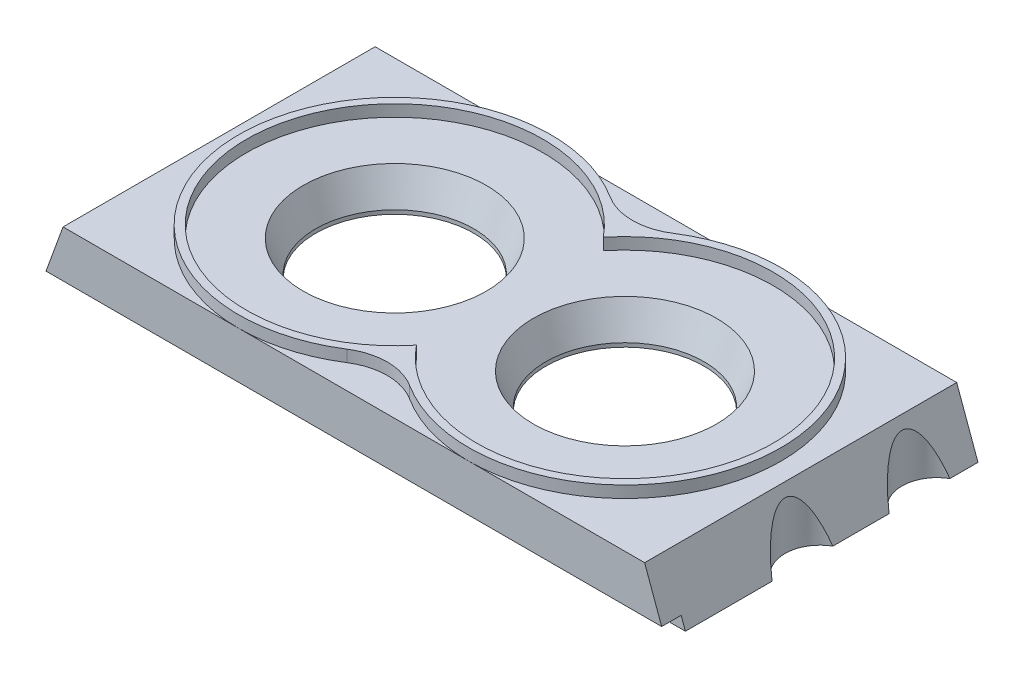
ISO-10303-21;
HEADER;
FILE_DESCRIPTION(('STEP AP214'),'2;1');
FILE_NAME('part.step','',(''),(''),'','','');
FILE_SCHEMA(('AUTOMOTIVE_DESIGN { 1 0 10303 214 1 1 1 1 }'));
ENDSEC;
DATA;
#1=APPLICATION_CONTEXT('core data for automotive mechanical design processes');
#2=APPLICATION_PROTOCOL_DEFINITION('international standard','automotive_design',2000,#1);
#3=PRODUCT_CONTEXT('',#1,'mechanical');
#4=PRODUCT('Part','Part','',(#3));
#5=PRODUCT_RELATED_PRODUCT_CATEGORY('part','',(#4));
#6=PRODUCT_DEFINITION_FORMATION('','',#4);
#7=PRODUCT_DEFINITION_CONTEXT('part definition',#1,'design');
#8=PRODUCT_DEFINITION('design','',#6,#7);
#9=PRODUCT_DEFINITION_SHAPE('','',#8);
#10=(LENGTH_UNIT() NAMED_UNIT(*) SI_UNIT(.MILLI.,.METRE.));
#11=(NAMED_UNIT(*) PLANE_ANGLE_UNIT() SI_UNIT($,.RADIAN.));
#12=(NAMED_UNIT(*) SI_UNIT($,.STERADIAN.) SOLID_ANGLE_UNIT());
#13=UNCERTAINTY_MEASURE_WITH_UNIT(LENGTH_MEASURE(1.E-05),#10,'distance_accuracy_value','');
#14=(GEOMETRIC_REPRESENTATION_CONTEXT(3) GLOBAL_UNCERTAINTY_ASSIGNED_CONTEXT((#13)) GLOBAL_UNIT_ASSIGNED_CONTEXT((#10,
#11,#12)) REPRESENTATION_CONTEXT('',''));
#15=CARTESIAN_POINT('',(0.,0.,0.));
#16=DIRECTION('',(0.,0.,1.));
#17=DIRECTION('',(1.,0.,0.));
#18=AXIS2_PLACEMENT_3D('',#15,#16,#17);
#19=CARTESIAN_POINT('',(-4.,13.61362956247,0.));
#20=DIRECTION('',(0.,-1.,0.));
#21=DIRECTION('',(0.,0.,-1.));
#22=AXIS2_PLACEMENT_3D('',#19,#20,#21);
#23=CYLINDRICAL_SURFACE('',#22,1.5);
#24=CARTESIAN_POINT('',(-4.,11.,0.));
#25=DIRECTION('',(0.,-1.,0.));
#26=DIRECTION('',(0.,0.,-1.));
#27=AXIS2_PLACEMENT_3D('',#24,#25,#26);
#28=CIRCLE('',#27,1.5);
#29=CARTESIAN_POINT('',(-4.,11.,-1.5));
#30=VERTEX_POINT('',#29);
#31=EDGE_CURVE('P0_E11',#30,#30,#28,.T.);
#32=ORIENTED_EDGE('',*,*,#31,.T.);
#33=EDGE_LOOP('',(#32));
#34=FACE_BOUND('',#33,.T.);
#35=CARTESIAN_POINT('',(-4.,6.00000000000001,0.));
#36=DIRECTION('',(0.,-1.,0.));
#37=DIRECTION('',(0.,0.,-1.));
#38=AXIS2_PLACEMENT_3D('',#35,#36,#37);
#39=CIRCLE('',#38,1.5);
#40=CARTESIAN_POINT('',(-4.,6.00000000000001,-1.5));
#41=VERTEX_POINT('',#40);
#42=EDGE_CURVE('P0_E23',#41,#41,#39,.F.);
#43=ORIENTED_EDGE('',*,*,#42,.T.);
#44=EDGE_LOOP('',(#43));
#45=FACE_BOUND('',#44,.T.);
#46=ADVANCED_FACE('P0_F16',(#34,#45),#23,.T.);
#47=CARTESIAN_POINT('',(-4.,11.,0.));
#48=DIRECTION('',(0.,-1.,0.));
#49=DIRECTION('',(0.,0.,-1.));
#50=AXIS2_PLACEMENT_3D('',#47,#48,#49);
#51=PLANE('',#50);
#52=CARTESIAN_POINT('',(-2.75,11.,0.));
#53=CARTESIAN_POINT('',(-2.75020255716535,11.,-0.238673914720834));
#54=CARTESIAN_POINT('',(-2.83776462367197,11.,-0.460118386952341));
#55=CARTESIAN_POINT('',(-2.93276471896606,11.,-0.700373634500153));
#56=CARTESIAN_POINT('',(-3.11611652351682,11.,-0.883883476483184));
#57=CARTESIAN_POINT('',(-3.29872345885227,11.,-1.06664780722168));
#58=CARTESIAN_POINT('',(-3.53988161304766,11.,-1.16223537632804));
#59=CARTESIAN_POINT('',(-3.76104742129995,11.,-1.24989860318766));
#60=CARTESIAN_POINT('',(-4.,11.,-1.25));
#61=CARTESIAN_POINT('',(-4.23790633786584,11.,-1.25010095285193));
#62=CARTESIAN_POINT('',(-4.46011838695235,11.,-1.16223537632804));
#63=CARTESIAN_POINT('',(-4.70037363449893,11.,-1.06723528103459));
#64=CARTESIAN_POINT('',(-4.88388347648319,11.,-0.883883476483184));
#65=CARTESIAN_POINT('',(-5.06664780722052,11.,-0.701276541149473));
#66=CARTESIAN_POINT('',(-5.16223537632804,11.,-0.460118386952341));
#67=CARTESIAN_POINT('',(-5.24979698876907,11.,-0.239208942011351));
#68=CARTESIAN_POINT('',(-5.25,11.,0.));
#69=B_SPLINE_CURVE_WITH_KNOTS('',2,(#52,#53,#54,#55,#56,#57,#58,#59,#60,#61,#62,#63,#64,#65,#66,
#67,#68),.UNSPECIFIED.,.F.,.F.,(3,2,2,2,2,2,2,2,3),(0.,0.125,0.25,0.375,0.5,0.625,0.75,0.875,
1.),.UNSPECIFIED.);
#70=CARTESIAN_POINT('',(-2.74999999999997,11.,0.));
#71=VERTEX_POINT('',#70);
#72=CARTESIAN_POINT('',(-5.24999999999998,11.,0.));
#73=VERTEX_POINT('',#72);
#74=EDGE_CURVE('P0_E27',#71,#73,#69,.T.);
#75=ORIENTED_EDGE('',*,*,#74,.F.);
#76=CARTESIAN_POINT('',(-5.25,11.,0.));
#77=CARTESIAN_POINT('',(-5.24979744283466,11.,0.23867391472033));
#78=CARTESIAN_POINT('',(-5.16223537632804,11.,0.460118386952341));
#79=CARTESIAN_POINT('',(-5.06723528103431,11.,0.700373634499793));
#80=CARTESIAN_POINT('',(-4.88388347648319,11.,0.883883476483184));
#81=CARTESIAN_POINT('',(-4.70127654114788,11.,1.06664780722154));
#82=CARTESIAN_POINT('',(-4.46011838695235,11.,1.16223537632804));
#83=CARTESIAN_POINT('',(-4.23895257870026,11.,1.24989860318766));
#84=CARTESIAN_POINT('',(-4.,11.,1.25));
#85=CARTESIAN_POINT('',(-3.76209366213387,11.,1.25010095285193));
#86=CARTESIAN_POINT('',(-3.53988161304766,11.,1.16223537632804));
#87=CARTESIAN_POINT('',(-3.2996263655,11.,1.06723528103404));
#88=CARTESIAN_POINT('',(-3.11611652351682,11.,0.883883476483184));
#89=CARTESIAN_POINT('',(-2.93335219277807,11.,0.701276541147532));
#90=CARTESIAN_POINT('',(-2.83776462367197,11.,0.460118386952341));
#91=CARTESIAN_POINT('',(-2.75020301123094,11.,0.239208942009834));
#92=CARTESIAN_POINT('',(-2.75,11.,0.));
#93=B_SPLINE_CURVE_WITH_KNOTS('',2,(#76,#77,#78,#79,#80,#81,#82,#83,#84,#85,#86,#87,#88,#89,#90,
#91,#92),.UNSPECIFIED.,.F.,.F.,(3,2,2,2,2,2,2,2,3),(0.,0.125,0.25,0.375,0.5,0.625,0.75,0.875,
1.),.UNSPECIFIED.);
#94=EDGE_CURVE('P0_E32',#73,#71,#93,.T.);
#95=ORIENTED_EDGE('',*,*,#94,.F.);
#96=EDGE_LOOP('',(#75,#95));
#97=FACE_BOUND('',#96,.T.);
#98=ORIENTED_EDGE('',*,*,#31,.F.);
#99=EDGE_LOOP('',(#98));
#100=FACE_BOUND('',#99,.T.);
#101=ADVANCED_FACE('P0_F17',(#97,#100),#51,.F.);
#102=OPEN_SHELL('',(#46,#101));
#103=SHELL_BASED_SURFACE_MODEL('P0_B1',(#102));
#104=CARTESIAN_POINT('',(-55.,12.4999999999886,0.));
#105=DIRECTION('',(0.,-1.,0.));
#106=DIRECTION('',(0.,0.,-1.));
#107=AXIS2_PLACEMENT_3D('',#104,#105,#106);
#108=CONICAL_SURFACE('',#107,1.25000000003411,1.02974425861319);
#109=CARTESIAN_POINT('',(-55.,12.5,0.));
#110=DIRECTION('',(0.,-1.,0.));
#111=DIRECTION('',(0.,0.,-1.));
#112=AXIS2_PLACEMENT_3D('',#109,#110,#111);
#113=CIRCLE('',#112,1.25);
#114=CARTESIAN_POINT('',(-55.,12.5,-1.25));
#115=VERTEX_POINT('',#114);
#116=EDGE_CURVE('P1_E711',#115,#115,#113,.T.);
#117=ORIENTED_EDGE('',*,*,#116,.T.);
#118=EDGE_LOOP('',(#117));
#119=FACE_BOUND('',#118,.T.);
#120=CARTESIAN_POINT('',(-55.0000000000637,13.2510757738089,0.));
#121=VERTEX_POINT('',#120);
#122=VERTEX_LOOP('',#121);
#123=FACE_BOUND('',#122,.T.);
#124=ADVANCED_FACE('P1_F18',(#119,#123),#108,.F.);
#125=CARTESIAN_POINT('',(-29.5,12.4999999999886,-25.5));
#126=DIRECTION('',(0.,-1.,0.));
#127=DIRECTION('',(0.,0.,-1.));
#128=AXIS2_PLACEMENT_3D('',#125,#126,#127);
#129=CONICAL_SURFACE('',#128,1.24999999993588,1.0297442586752);
#130=CARTESIAN_POINT('',(-29.5,12.5,-25.5));
#131=DIRECTION('',(0.,-1.,0.));
#132=DIRECTION('',(0.,0.,-1.));
#133=AXIS2_PLACEMENT_3D('',#130,#131,#132);
#134=CIRCLE('',#133,1.25);
#135=CARTESIAN_POINT('',(-29.5,12.5,-26.75));
#136=VERTEX_POINT('',#135);
#137=EDGE_CURVE('P1_E732',#136,#136,#134,.T.);
#138=ORIENTED_EDGE('',*,*,#137,.T.);
#139=EDGE_LOOP('',(#138));
#140=FACE_BOUND('',#139,.T.);
#141=CARTESIAN_POINT('',(-29.5,13.2510757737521,-25.5000000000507));
#142=VERTEX_POINT('',#141);
#143=VERTEX_LOOP('',#142);
#144=FACE_BOUND('',#143,.T.);
#145=ADVANCED_FACE('P1_F189',(#140,#144),#129,.F.);
#146=CARTESIAN_POINT('',(-4.,12.4999999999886,0.));
#147=DIRECTION('',(0.,-1.,0.));
#148=DIRECTION('',(0.,0.,-1.));
#149=AXIS2_PLACEMENT_3D('',#146,#147,#148);
#150=CONICAL_SURFACE('',#149,1.2499999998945,1.02974425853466);
#151=CARTESIAN_POINT('',(-4.,12.5,0.));
#152=DIRECTION('',(0.,-1.,0.));
#153=DIRECTION('',(0.,0.,-1.));
#154=AXIS2_PLACEMENT_3D('',#151,#152,#153);
#155=CIRCLE('',#154,1.25);
#156=CARTESIAN_POINT('',(-4.,12.5,-1.25));
#157=VERTEX_POINT('',#156);
#158=EDGE_CURVE('P1_E729',#157,#157,#155,.T.);
#159=ORIENTED_EDGE('',*,*,#158,.T.);
#160=EDGE_LOOP('',(#159));
#161=FACE_BOUND('',#160,.T.);
#162=CARTESIAN_POINT('',(-3.99999999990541,13.2510757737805,0.));
#163=VERTEX_POINT('',#162);
#164=VERTEX_LOOP('',#163);
#165=FACE_BOUND('',#164,.T.);
#166=ADVANCED_FACE('P1_F195',(#161,#165),#150,.F.);
#167=CARTESIAN_POINT('',(-29.5,12.4999999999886,25.5));
#168=DIRECTION('',(0.,-1.,0.));
#169=DIRECTION('',(0.,0.,-1.));
#170=AXIS2_PLACEMENT_3D('',#167,#168,#169);
#171=CONICAL_SURFACE('',#170,1.24999999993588,1.0297442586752);
#172=CARTESIAN_POINT('',(-29.5,12.5,25.5));
#173=DIRECTION('',(0.,-1.,0.));
#174=DIRECTION('',(0.,0.,-1.));
#175=AXIS2_PLACEMENT_3D('',#172,#173,#174);
#176=CIRCLE('',#175,1.25);
#177=CARTESIAN_POINT('',(-29.5,12.5,24.25));
#178=VERTEX_POINT('',#177);
#179=EDGE_CURVE('P1_E726',#178,#178,#176,.T.);
#180=ORIENTED_EDGE('',*,*,#179,.T.);
#181=EDGE_LOOP('',(#180));
#182=FACE_BOUND('',#181,.T.);
#183=CARTESIAN_POINT('',(-29.5,13.2510757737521,25.5000000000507));
#184=VERTEX_POINT('',#183);
#185=VERTEX_LOOP('',#184);
#186=FACE_BOUND('',#185,.T.);
#187=ADVANCED_FACE('P1_F1572',(#182,#186),#171,.F.);
#188=CARTESIAN_POINT('',(4.,12.4999999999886,0.));
#189=DIRECTION('',(0.,-1.,0.));
#190=DIRECTION('',(0.,0.,-1.));
#191=AXIS2_PLACEMENT_3D('',#188,#189,#190);
#192=CONICAL_SURFACE('',#191,1.2499999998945,1.02974425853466);
#193=CARTESIAN_POINT('',(4.,12.5,0.));
#194=DIRECTION('',(0.,-1.,0.));
#195=DIRECTION('',(0.,0.,-1.));
#196=AXIS2_PLACEMENT_3D('',#193,#194,#195);
#197=CIRCLE('',#196,1.25);
#198=CARTESIAN_POINT('',(4.,12.5,-1.25));
#199=VERTEX_POINT('',#198);
#200=EDGE_CURVE('P1_E723',#199,#199,#197,.T.);
#201=ORIENTED_EDGE('',*,*,#200,.T.);
#202=EDGE_LOOP('',(#201));
#203=FACE_BOUND('',#202,.T.);
#204=CARTESIAN_POINT('',(3.99999999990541,13.2510757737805,0.));
#205=VERTEX_POINT('',#204);
#206=VERTEX_LOOP('',#205);
#207=FACE_BOUND('',#206,.T.);
#208=ADVANCED_FACE('P1_F1568',(#203,#207),#192,.F.);
#209=CARTESIAN_POINT('',(29.5,12.4999999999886,25.5));
#210=DIRECTION('',(0.,-1.,0.));
#211=DIRECTION('',(0.,0.,-1.));
#212=AXIS2_PLACEMENT_3D('',#209,#210,#211);
#213=CONICAL_SURFACE('',#212,1.24999999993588,1.0297442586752);
#214=CARTESIAN_POINT('',(29.5,12.5,25.5));
#215=DIRECTION('',(0.,-1.,0.));
#216=DIRECTION('',(0.,0.,-1.));
#217=AXIS2_PLACEMENT_3D('',#214,#215,#216);
#218=CIRCLE('',#217,1.25);
#219=CARTESIAN_POINT('',(29.5,12.5,24.25));
#220=VERTEX_POINT('',#219);
#221=EDGE_CURVE('P1_E720',#220,#220,#218,.T.);
#222=ORIENTED_EDGE('',*,*,#221,.T.);
#223=EDGE_LOOP('',(#222));
#224=FACE_BOUND('',#223,.T.);
#225=CARTESIAN_POINT('',(29.5,13.2510757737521,25.5000000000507));
#226=VERTEX_POINT('',#225);
#227=VERTEX_LOOP('',#226);
#228=FACE_BOUND('',#227,.T.);
#229=ADVANCED_FACE('P1_F1564',(#224,#228),#213,.F.);
#230=CARTESIAN_POINT('',(55.,12.4999999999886,0.));
#231=DIRECTION('',(0.,-1.,0.));
#232=DIRECTION('',(0.,0.,-1.));
#233=AXIS2_PLACEMENT_3D('',#230,#231,#232);
#234=CONICAL_SURFACE('',#233,1.25000000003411,1.02974425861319);
#235=CARTESIAN_POINT('',(55.,12.5,0.));
#236=DIRECTION('',(0.,-1.,0.));
#237=DIRECTION('',(0.,0.,-1.));
#238=AXIS2_PLACEMENT_3D('',#235,#236,#237);
#239=CIRCLE('',#238,1.25);
#240=CARTESIAN_POINT('',(55.,12.5,-1.24999999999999));
#241=VERTEX_POINT('',#240);
#242=EDGE_CURVE('P1_E717',#241,#241,#239,.T.);
#243=ORIENTED_EDGE('',*,*,#242,.T.);
#244=EDGE_LOOP('',(#243));
#245=FACE_BOUND('',#244,.T.);
#246=CARTESIAN_POINT('',(55.0000000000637,13.2510757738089,0.));
#247=VERTEX_POINT('',#246);
#248=VERTEX_LOOP('',#247);
#249=FACE_BOUND('',#248,.T.);
#250=ADVANCED_FACE('P1_F1558',(#245,#249),#234,.F.);
#251=CARTESIAN_POINT('',(29.5,12.4999999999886,-25.5));
#252=DIRECTION('',(0.,-1.,0.));
#253=DIRECTION('',(0.,0.,-1.));
#254=AXIS2_PLACEMENT_3D('',#251,#252,#253);
#255=CONICAL_SURFACE('',#254,1.24999999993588,1.0297442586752);
#256=CARTESIAN_POINT('',(29.5,12.5,-25.5));
#257=DIRECTION('',(0.,-1.,0.));
#258=DIRECTION('',(0.,0.,-1.));
#259=AXIS2_PLACEMENT_3D('',#256,#257,#258);
#260=CIRCLE('',#259,1.25);
#261=CARTESIAN_POINT('',(29.5,12.5,-26.75));
#262=VERTEX_POINT('',#261);
#263=EDGE_CURVE('P1_E713',#262,#262,#260,.T.);
#264=ORIENTED_EDGE('',*,*,#263,.T.);
#265=EDGE_LOOP('',(#264));
#266=FACE_BOUND('',#265,.T.);
#267=CARTESIAN_POINT('',(29.5,13.2510757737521,-25.5000000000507));
#268=VERTEX_POINT('',#267);
#269=VERTEX_LOOP('',#268);
#270=FACE_BOUND('',#269,.T.);
#271=ADVANCED_FACE('P1_F1551',(#266,#270),#255,.F.);
#272=CARTESIAN_POINT('',(0.,0.,0.));
#273=DIRECTION('',(0.,1.,0.));
#274=DIRECTION('',(0.,0.,1.));
#275=AXIS2_PLACEMENT_3D('',#272,#273,#274);
#276=PLANE('',#275);
#277=CARTESIAN_POINT('',(-29.5,0.,0.));
#278=DIRECTION('',(0.,1.,0.));
#279=DIRECTION('',(0.,0.,1.));
#280=AXIS2_PLACEMENT_3D('',#277,#278,#279);
#281=CIRCLE('',#280,29.);
#282=CARTESIAN_POINT('',(-26.0999999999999,0.,28.8));
#283=VERTEX_POINT('',#282);
#284=CARTESIAN_POINT('',(-29.5,0.,-29.));
#285=VERTEX_POINT('',#284);
#286=EDGE_CURVE('P1_E708',#283,#285,#281,.T.);
#287=ORIENTED_EDGE('',*,*,#286,.T.);
#288=DIRECTION('',(1.,0.,0.));
#289=VECTOR('',#288,1.);
#290=CARTESIAN_POINT('',(29.5,0.,-29.));
#291=LINE('',#290,#289);
#292=CARTESIAN_POINT('',(29.5,0.,-29.));
#293=VERTEX_POINT('',#292);
#294=EDGE_CURVE('P1_E704',#285,#293,#291,.T.);
#295=ORIENTED_EDGE('',*,*,#294,.T.);
#296=CARTESIAN_POINT('',(29.5,0.,0.));
#297=DIRECTION('',(0.,1.,0.));
#298=DIRECTION('',(0.,0.,1.));
#299=AXIS2_PLACEMENT_3D('',#296,#297,#298);
#300=CIRCLE('',#299,29.);
#301=CARTESIAN_POINT('',(26.0999999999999,0.,28.8));
#302=VERTEX_POINT('',#301);
#303=EDGE_CURVE('P1_E159',#293,#302,#300,.T.);
#304=ORIENTED_EDGE('',*,*,#303,.T.);
#305=DIRECTION('',(1.,0.,0.));
#306=VECTOR('',#305,1.);
#307=CARTESIAN_POINT('',(0.,0.,28.8));
#308=LINE('',#307,#306);
#309=EDGE_CURVE('P1_E709',#283,#302,#308,.T.);
#310=ORIENTED_EDGE('',*,*,#309,.F.);
#311=EDGE_LOOP('',(#287,#295,#304,#310));
#312=FACE_BOUND('',#311,.T.);
#313=ADVANCED_FACE('P1_F1544',(#312),#276,.F.);
#314=CARTESIAN_POINT('',(0.,0.099999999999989,28.9));
#315=DIRECTION('',(0.,-0.707106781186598,0.707106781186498));
#316=DIRECTION('',(0.,-0.707106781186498,-0.707106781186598));
#317=AXIS2_PLACEMENT_3D('',#314,#315,#316);
#318=PLANE('',#317);
#319=DIRECTION('',(-1.,0.,0.));
#320=VECTOR('',#319,1.);
#321=CARTESIAN_POINT('',(-29.5,0.200000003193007,29.));
#322=LINE('',#321,#320);
#323=CARTESIAN_POINT('',(29.5,0.200000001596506,29.));
#324=VERTEX_POINT('',#323);
#325=CARTESIAN_POINT('',(-29.500000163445,0.200000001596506,29.));
#326=VERTEX_POINT('',#325);
#327=EDGE_CURVE('P1_E705',#324,#326,#322,.T.);
#328=ORIENTED_EDGE('',*,*,#327,.T.);
#329=CARTESIAN_POINT('',(-29.5,-28.7999999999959,0.));
#330=DIRECTION('',(0.,-0.707106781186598,0.707106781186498));
#331=DIRECTION('',(0.,0.707106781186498,0.707106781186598));
#332=AXIS2_PLACEMENT_3D('',#329,#330,#331);
#333=ELLIPSE('',#332,41.0121933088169,29.);
#334=EDGE_CURVE('P1_E701',#326,#283,#333,.F.);
#335=ORIENTED_EDGE('',*,*,#334,.T.);
#336=ORIENTED_EDGE('',*,*,#309,.T.);
#337=CARTESIAN_POINT('',(29.5,-28.7999999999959,0.));
#338=DIRECTION('',(0.,-0.707106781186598,0.707106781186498));
#339=DIRECTION('',(0.,0.707106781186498,0.707106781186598));
#340=AXIS2_PLACEMENT_3D('',#337,#338,#339);
#341=ELLIPSE('',#340,41.0121933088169,29.);
#342=EDGE_CURVE('P1_E716',#302,#324,#341,.F.);
#343=ORIENTED_EDGE('',*,*,#342,.T.);
#344=EDGE_LOOP('',(#328,#335,#336,#343));
#345=FACE_BOUND('',#344,.T.);
#346=ADVANCED_FACE('P1_F1287',(#345),#318,.T.);
#347=CARTESIAN_POINT('',(-55.,13.61362956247,0.));
#348=DIRECTION('',(0.,-1.,0.));
#349=DIRECTION('',(0.,0.,-1.));
#350=AXIS2_PLACEMENT_3D('',#347,#348,#349);
#351=CYLINDRICAL_SURFACE('',#350,1.25);
#352=ORIENTED_EDGE('',*,*,#116,.F.);
#353=EDGE_LOOP('',(#352));
#354=FACE_BOUND('',#353,.T.);
#355=CARTESIAN_POINT('',(-55.,6.00000000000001,0.));
#356=DIRECTION('',(0.,-1.,0.));
#357=DIRECTION('',(0.,0.,-1.));
#358=AXIS2_PLACEMENT_3D('',#355,#356,#357);
#359=CIRCLE('',#358,1.25);
#360=CARTESIAN_POINT('',(-55.,6.00000000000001,-1.25));
#361=VERTEX_POINT('',#360);
#362=EDGE_CURVE('P1_E853',#361,#361,#359,.T.);
#363=ORIENTED_EDGE('',*,*,#362,.T.);
#364=EDGE_LOOP('',(#363));
#365=FACE_BOUND('',#364,.T.);
#366=ADVANCED_FACE('P1_F1281',(#354,#365),#351,.F.);
#367=CARTESIAN_POINT('',(-29.5,13.61362956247,-25.5));
#368=DIRECTION('',(0.,-1.,0.));
#369=DIRECTION('',(0.,0.,-1.));
#370=AXIS2_PLACEMENT_3D('',#367,#368,#369);
#371=CYLINDRICAL_SURFACE('',#370,1.25);
#372=ORIENTED_EDGE('',*,*,#137,.F.);
#373=EDGE_LOOP('',(#372));
#374=FACE_BOUND('',#373,.T.);
#375=CARTESIAN_POINT('',(-29.5,6.00000000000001,-25.5));
#376=DIRECTION('',(0.,-1.,0.));
#377=DIRECTION('',(0.,0.,-1.));
#378=AXIS2_PLACEMENT_3D('',#375,#376,#377);
#379=CIRCLE('',#378,1.25);
#380=CARTESIAN_POINT('',(-29.5,6.00000000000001,-26.75));
#381=VERTEX_POINT('',#380);
#382=EDGE_CURVE('P1_E850',#381,#381,#379,.T.);
#383=ORIENTED_EDGE('',*,*,#382,.T.);
#384=EDGE_LOOP('',(#383));
#385=FACE_BOUND('',#384,.T.);
#386=ADVANCED_FACE('P1_F1286',(#374,#385),#371,.F.);
#387=CARTESIAN_POINT('',(-4.,13.61362956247,0.));
#388=DIRECTION('',(0.,-1.,0.));
#389=DIRECTION('',(0.,0.,-1.));
#390=AXIS2_PLACEMENT_3D('',#387,#388,#389);
#391=CYLINDRICAL_SURFACE('',#390,1.25);
#392=ORIENTED_EDGE('',*,*,#158,.F.);
#393=EDGE_LOOP('',(#392));
#394=FACE_BOUND('',#393,.T.);
#395=CARTESIAN_POINT('',(-4.,6.00000000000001,0.));
#396=DIRECTION('',(0.,-1.,0.));
#397=DIRECTION('',(0.,0.,-1.));
#398=AXIS2_PLACEMENT_3D('',#395,#396,#397);
#399=CIRCLE('',#398,1.25);
#400=CARTESIAN_POINT('',(-4.,6.00000000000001,-1.25));
#401=VERTEX_POINT('',#400);
#402=EDGE_CURVE('P1_E847',#401,#401,#399,.T.);
#403=ORIENTED_EDGE('',*,*,#402,.T.);
#404=EDGE_LOOP('',(#403));
#405=FACE_BOUND('',#404,.T.);
#406=ADVANCED_FACE('P1_F1271',(#394,#405),#391,.F.);
#407=CARTESIAN_POINT('',(-29.5,13.61362956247,25.5));
#408=DIRECTION('',(0.,-1.,0.));
#409=DIRECTION('',(0.,0.,-1.));
#410=AXIS2_PLACEMENT_3D('',#407,#408,#409);
#411=CYLINDRICAL_SURFACE('',#410,1.25);
#412=ORIENTED_EDGE('',*,*,#179,.F.);
#413=EDGE_LOOP('',(#412));
#414=FACE_BOUND('',#413,.T.);
#415=CARTESIAN_POINT('',(-29.5,6.00000000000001,25.5));
#416=DIRECTION('',(0.,-1.,0.));
#417=DIRECTION('',(0.,0.,-1.));
#418=AXIS2_PLACEMENT_3D('',#415,#416,#417);
#419=CIRCLE('',#418,1.25);
#420=CARTESIAN_POINT('',(-29.5,6.00000000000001,24.25));
#421=VERTEX_POINT('',#420);
#422=EDGE_CURVE('P1_E844',#421,#421,#419,.T.);
#423=ORIENTED_EDGE('',*,*,#422,.T.);
#424=EDGE_LOOP('',(#423));
#425=FACE_BOUND('',#424,.T.);
#426=ADVANCED_FACE('P1_F1264',(#414,#425),#411,.F.);
#427=CARTESIAN_POINT('',(4.,13.61362956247,0.));
#428=DIRECTION('',(0.,-1.,0.));
#429=DIRECTION('',(0.,0.,-1.));
#430=AXIS2_PLACEMENT_3D('',#427,#428,#429);
#431=CYLINDRICAL_SURFACE('',#430,1.25);
#432=ORIENTED_EDGE('',*,*,#200,.F.);
#433=EDGE_LOOP('',(#432));
#434=FACE_BOUND('',#433,.T.);
#435=CARTESIAN_POINT('',(4.,6.00000000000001,0.));
#436=DIRECTION('',(0.,-1.,0.));
#437=DIRECTION('',(0.,0.,-1.));
#438=AXIS2_PLACEMENT_3D('',#435,#436,#437);
#439=CIRCLE('',#438,1.25);
#440=CARTESIAN_POINT('',(4.,6.00000000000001,-1.25));
#441=VERTEX_POINT('',#440);
#442=EDGE_CURVE('P1_E838',#441,#441,#439,.T.);
#443=ORIENTED_EDGE('',*,*,#442,.T.);
#444=EDGE_LOOP('',(#443));
#445=FACE_BOUND('',#444,.T.);
#446=ADVANCED_FACE('P1_F1270',(#434,#445),#431,.F.);
#447=CARTESIAN_POINT('',(29.5,13.61362956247,25.5));
#448=DIRECTION('',(0.,-1.,0.));
#449=DIRECTION('',(0.,0.,-1.));
#450=AXIS2_PLACEMENT_3D('',#447,#448,#449);
#451=CYLINDRICAL_SURFACE('',#450,1.25);
#452=ORIENTED_EDGE('',*,*,#221,.F.);
#453=EDGE_LOOP('',(#452));
#454=FACE_BOUND('',#453,.T.);
#455=CARTESIAN_POINT('',(29.5,6.00000000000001,25.5));
#456=DIRECTION('',(0.,-1.,0.));
#457=DIRECTION('',(0.,0.,-1.));
#458=AXIS2_PLACEMENT_3D('',#455,#456,#457);
#459=CIRCLE('',#458,1.25);
#460=CARTESIAN_POINT('',(29.5,6.00000000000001,24.25));
#461=VERTEX_POINT('',#460);
#462=EDGE_CURVE('P1_E835',#461,#461,#459,.T.);
#463=ORIENTED_EDGE('',*,*,#462,.T.);
#464=EDGE_LOOP('',(#463));
#465=FACE_BOUND('',#464,.T.);
#466=ADVANCED_FACE('P1_F1314',(#454,#465),#451,.F.);
#467=CARTESIAN_POINT('',(55.,13.61362956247,0.));
#468=DIRECTION('',(0.,-1.,0.));
#469=DIRECTION('',(0.,0.,-1.));
#470=AXIS2_PLACEMENT_3D('',#467,#468,#469);
#471=CYLINDRICAL_SURFACE('',#470,1.25);
#472=ORIENTED_EDGE('',*,*,#242,.F.);
#473=EDGE_LOOP('',(#472));
#474=FACE_BOUND('',#473,.T.);
#475=CARTESIAN_POINT('',(55.,6.00000000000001,0.));
#476=DIRECTION('',(0.,-1.,0.));
#477=DIRECTION('',(0.,0.,-1.));
#478=AXIS2_PLACEMENT_3D('',#475,#476,#477);
#479=CIRCLE('',#478,1.25);
#480=CARTESIAN_POINT('',(55.,6.00000000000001,-1.24999999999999));
#481=VERTEX_POINT('',#480);
#482=EDGE_CURVE('P1_E832',#481,#481,#479,.T.);
#483=ORIENTED_EDGE('',*,*,#482,.T.);
#484=EDGE_LOOP('',(#483));
#485=FACE_BOUND('',#484,.T.);
#486=ADVANCED_FACE('P1_F1319',(#474,#485),#471,.F.);
#487=CARTESIAN_POINT('',(29.5,13.61362956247,-25.5));
#488=DIRECTION('',(0.,-1.,0.));
#489=DIRECTION('',(0.,0.,-1.));
#490=AXIS2_PLACEMENT_3D('',#487,#488,#489);
#491=CYLINDRICAL_SURFACE('',#490,1.25);
#492=ORIENTED_EDGE('',*,*,#263,.F.);
#493=EDGE_LOOP('',(#492));
#494=FACE_BOUND('',#493,.T.);
#495=CARTESIAN_POINT('',(29.5,6.00000000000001,-25.5));
#496=DIRECTION('',(0.,-1.,0.));
#497=DIRECTION('',(0.,0.,-1.));
#498=AXIS2_PLACEMENT_3D('',#495,#496,#497);
#499=CIRCLE('',#498,1.25);
#500=CARTESIAN_POINT('',(29.5,6.00000000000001,-26.75));
#501=VERTEX_POINT('',#500);
#502=EDGE_CURVE('P1_E829',#501,#501,#499,.T.);
#503=ORIENTED_EDGE('',*,*,#502,.T.);
#504=EDGE_LOOP('',(#503));
#505=FACE_BOUND('',#504,.T.);
#506=ADVANCED_FACE('P1_F1336',(#494,#505),#491,.F.);
#507=CARTESIAN_POINT('',(29.5,0.,0.));
#508=DIRECTION('',(0.,1.,0.));
#509=DIRECTION('',(0.,0.,1.));
#510=AXIS2_PLACEMENT_3D('',#507,#508,#509);
#511=CYLINDRICAL_SURFACE('',#510,29.);
#512=CARTESIAN_POINT('',(29.5,6.00000000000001,0.));
#513=DIRECTION('',(0.,1.,0.));
#514=DIRECTION('',(0.,0.,1.));
#515=AXIS2_PLACEMENT_3D('',#512,#513,#514);
#516=CIRCLE('',#515,29.);
#517=CARTESIAN_POINT('',(29.5,6.00000000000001,29.));
#518=VERTEX_POINT('',#517);
#519=EDGE_CURVE('P1_E841',#518,#518,#516,.T.);
#520=ORIENTED_EDGE('',*,*,#519,.T.);
#521=EDGE_LOOP('',(#520));
#522=FACE_BOUND('',#521,.T.);
#523=ORIENTED_EDGE('',*,*,#342,.F.);
#524=ORIENTED_EDGE('',*,*,#303,.F.);
#525=DIRECTION('',(0.,1.,0.));
#526=VECTOR('',#525,1.);
#527=CARTESIAN_POINT('',(29.5,0.,-29.));
#528=LINE('',#527,#526);
#529=CARTESIAN_POINT('',(29.5,2.3,-29.));
#530=VERTEX_POINT('',#529);
#531=EDGE_CURVE('P1_E702',#293,#530,#528,.T.);
#532=ORIENTED_EDGE('',*,*,#531,.T.);
#533=CARTESIAN_POINT('',(29.5,2.3,0.));
#534=DIRECTION('',(0.,1.,0.));
#535=DIRECTION('',(0.,0.,1.));
#536=AXIS2_PLACEMENT_3D('',#533,#534,#535);
#537=CIRCLE('',#536,29.);
#538=CARTESIAN_POINT('',(29.5,2.3,29.));
#539=VERTEX_POINT('',#538);
#540=EDGE_CURVE('P1_E826',#539,#530,#537,.T.);
#541=ORIENTED_EDGE('',*,*,#540,.F.);
#542=DIRECTION('',(0.,1.,0.));
#543=VECTOR('',#542,1.);
#544=CARTESIAN_POINT('',(29.5,0.,29.));
#545=LINE('',#544,#543);
#546=EDGE_CURVE('P1_E859',#539,#324,#545,.F.);
#547=ORIENTED_EDGE('',*,*,#546,.T.);
#548=EDGE_LOOP('',(#523,#524,#532,#541,#547));
#549=FACE_BOUND('',#548,.T.);
#550=ADVANCED_FACE('P1_F1341',(#522,#549),#511,.F.);
#551=CARTESIAN_POINT('',(29.5,0.,-29.));
#552=DIRECTION('',(0.,0.,1.));
#553=DIRECTION('',(1.,0.,0.));
#554=AXIS2_PLACEMENT_3D('',#551,#552,#553);
#555=PLANE('',#554);
#556=DIRECTION('',(1.,0.,0.));
#557=VECTOR('',#556,1.);
#558=CARTESIAN_POINT('',(0.,2.3,-29.));
#559=LINE('',#558,#557);
#560=CARTESIAN_POINT('',(-29.5,2.3,-29.));
#561=VERTEX_POINT('',#560);
#562=EDGE_CURVE('P1_E646',#530,#561,#559,.F.);
#563=ORIENTED_EDGE('',*,*,#562,.F.);
#564=ORIENTED_EDGE('',*,*,#531,.F.);
#565=ORIENTED_EDGE('',*,*,#294,.F.);
#566=DIRECTION('',(0.,1.,0.));
#567=VECTOR('',#566,1.);
#568=CARTESIAN_POINT('',(-29.5,0.,-29.));
#569=LINE('',#568,#567);
#570=EDGE_CURVE('P1_E693',#285,#561,#569,.T.);
#571=ORIENTED_EDGE('',*,*,#570,.T.);
#572=EDGE_LOOP('',(#563,#564,#565,#571));
#573=FACE_BOUND('',#572,.T.);
#574=ADVANCED_FACE('P1_F1364',(#573),#555,.F.);
#575=CARTESIAN_POINT('',(-29.5,0.,0.));
#576=DIRECTION('',(0.,1.,0.));
#577=DIRECTION('',(0.,0.,1.));
#578=AXIS2_PLACEMENT_3D('',#575,#576,#577);
#579=CYLINDRICAL_SURFACE('',#578,29.);
#580=CARTESIAN_POINT('',(-29.5,6.00000000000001,0.));
#581=DIRECTION('',(0.,1.,0.));
#582=DIRECTION('',(0.,0.,1.));
#583=AXIS2_PLACEMENT_3D('',#580,#581,#582);
#584=CIRCLE('',#583,29.);
#585=CARTESIAN_POINT('',(-29.5,6.00000000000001,29.));
#586=VERTEX_POINT('',#585);
#587=EDGE_CURVE('P1_E856',#586,#586,#584,.T.);
#588=ORIENTED_EDGE('',*,*,#587,.T.);
#589=EDGE_LOOP('',(#588));
#590=FACE_BOUND('',#589,.T.);
#591=CARTESIAN_POINT('',(-29.5,2.3,0.));
#592=DIRECTION('',(0.,1.,0.));
#593=DIRECTION('',(0.,0.,1.));
#594=AXIS2_PLACEMENT_3D('',#591,#592,#593);
#595=CIRCLE('',#594,29.);
#596=CARTESIAN_POINT('',(-29.500000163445,2.3,29.));
#597=VERTEX_POINT('',#596);
#598=EDGE_CURVE('P1_E823',#561,#597,#595,.T.);
#599=ORIENTED_EDGE('',*,*,#598,.F.);
#600=ORIENTED_EDGE('',*,*,#570,.F.);
#601=ORIENTED_EDGE('',*,*,#286,.F.);
#602=ORIENTED_EDGE('',*,*,#334,.F.);
#603=DIRECTION('',(0.,1.,0.));
#604=VECTOR('',#603,1.);
#605=CARTESIAN_POINT('',(-29.50000032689,0.,29.));
#606=LINE('',#605,#604);
#607=EDGE_CURVE('P1_E707',#326,#597,#606,.T.);
#608=ORIENTED_EDGE('',*,*,#607,.T.);
#609=EDGE_LOOP('',(#599,#600,#601,#602,#608));
#610=FACE_BOUND('',#609,.T.);
#611=ADVANCED_FACE('P1_F1372',(#590,#610),#579,.F.);
#612=CARTESIAN_POINT('',(-29.5,0.,29.));
#613=DIRECTION('',(0.,0.,-1.));
#614=DIRECTION('',(-1.,0.,0.));
#615=AXIS2_PLACEMENT_3D('',#612,#613,#614);
#616=PLANE('',#615);
#617=DIRECTION('',(1.,0.,0.));
#618=VECTOR('',#617,1.);
#619=CARTESIAN_POINT('',(0.,2.3,29.));
#620=LINE('',#619,#618);
#621=EDGE_CURVE('P1_E822',#597,#539,#620,.T.);
#622=ORIENTED_EDGE('',*,*,#621,.F.);
#623=ORIENTED_EDGE('',*,*,#607,.F.);
#624=ORIENTED_EDGE('',*,*,#327,.F.);
#625=ORIENTED_EDGE('',*,*,#546,.F.);
#626=EDGE_LOOP('',(#622,#623,#624,#625));
#627=FACE_BOUND('',#626,.T.);
#628=ADVANCED_FACE('P1_F1380',(#627),#616,.F.);
#629=CARTESIAN_POINT('',(-29.5,6.00000000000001,0.));
#630=DIRECTION('',(0.,1.,0.));
#631=DIRECTION('',(0.,0.,1.));
#632=AXIS2_PLACEMENT_3D('',#629,#630,#631);
#633=PLANE('',#632);
#634=CARTESIAN_POINT('',(-29.5,5.99999999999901,-6.38378239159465E-13));
#635=DIRECTION('',(0.,-1.,0.));
#636=DIRECTION('',(1.,0.,0.));
#637=AXIS2_PLACEMENT_3D('',#634,#635,#636);
#638=CIRCLE('',#637,22.949999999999);
#639=CARTESIAN_POINT('',(-6.55000000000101,5.99999999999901,-6.38378239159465E-13));
#640=VERTEX_POINT('',#639);
#641=EDGE_CURVE('P1_E819',#640,#640,#638,.F.);
#642=ORIENTED_EDGE('',*,*,#641,.T.);
#643=EDGE_LOOP('',(#642));
#644=FACE_BOUND('',#643,.T.);
#645=ORIENTED_EDGE('',*,*,#422,.F.);
#646=EDGE_LOOP('',(#645));
#647=FACE_BOUND('',#646,.T.);
#648=ORIENTED_EDGE('',*,*,#402,.F.);
#649=EDGE_LOOP('',(#648));
#650=FACE_BOUND('',#649,.T.);
#651=ORIENTED_EDGE('',*,*,#382,.F.);
#652=EDGE_LOOP('',(#651));
#653=FACE_BOUND('',#652,.T.);
#654=ORIENTED_EDGE('',*,*,#362,.F.);
#655=EDGE_LOOP('',(#654));
#656=FACE_BOUND('',#655,.T.);
#657=ORIENTED_EDGE('',*,*,#587,.F.);
#658=EDGE_LOOP('',(#657));
#659=FACE_BOUND('',#658,.T.);
#660=ADVANCED_FACE('P1_F1388',(#644,#647,#650,#653,#656,#659),#633,.F.);
#661=CARTESIAN_POINT('',(29.5,6.00000000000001,0.));
#662=DIRECTION('',(0.,1.,0.));
#663=DIRECTION('',(0.,0.,1.));
#664=AXIS2_PLACEMENT_3D('',#661,#662,#663);
#665=PLANE('',#664);
#666=CARTESIAN_POINT('',(29.5,5.99999999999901,-6.38378239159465E-13));
#667=DIRECTION('',(0.,-1.,0.));
#668=DIRECTION('',(1.,0.,0.));
#669=AXIS2_PLACEMENT_3D('',#666,#667,#668);
#670=CIRCLE('',#669,22.949999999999);
#671=CARTESIAN_POINT('',(52.449999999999,5.99999999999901,-6.38378239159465E-13));
#672=VERTEX_POINT('',#671);
#673=EDGE_CURVE('P1_E627',#672,#672,#670,.F.);
#674=ORIENTED_EDGE('',*,*,#673,.T.);
#675=EDGE_LOOP('',(#674));
#676=FACE_BOUND('',#675,.T.);
#677=ORIENTED_EDGE('',*,*,#502,.F.);
#678=EDGE_LOOP('',(#677));
#679=FACE_BOUND('',#678,.T.);
#680=ORIENTED_EDGE('',*,*,#482,.F.);
#681=EDGE_LOOP('',(#680));
#682=FACE_BOUND('',#681,.T.);
#683=ORIENTED_EDGE('',*,*,#462,.F.);
#684=EDGE_LOOP('',(#683));
#685=FACE_BOUND('',#684,.T.);
#686=ORIENTED_EDGE('',*,*,#442,.F.);
#687=EDGE_LOOP('',(#686));
#688=FACE_BOUND('',#687,.T.);
#689=ORIENTED_EDGE('',*,*,#519,.F.);
#690=EDGE_LOOP('',(#689));
#691=FACE_BOUND('',#690,.T.);
#692=ADVANCED_FACE('P1_F1396',(#676,#679,#682,#685,#688,#691),#665,.F.);
#693=CARTESIAN_POINT('',(0.,2.3,0.));
#694=DIRECTION('',(0.,-1.,0.));
#695=DIRECTION('',(0.,0.,-1.));
#696=AXIS2_PLACEMENT_3D('',#693,#694,#695);
#697=PLANE('',#696);
#698=ORIENTED_EDGE('',*,*,#598,.T.);
#699=ORIENTED_EDGE('',*,*,#621,.T.);
#700=ORIENTED_EDGE('',*,*,#540,.T.);
#701=ORIENTED_EDGE('',*,*,#562,.T.);
#702=EDGE_LOOP('',(#698,#699,#700,#701));
#703=FACE_BOUND('',#702,.T.);
#704=CARTESIAN_POINT('',(-29.5,2.30000000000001,0.));
#705=DIRECTION('',(0.,1.,0.));
#706=DIRECTION('',(0.,0.,-1.));
#707=AXIS2_PLACEMENT_3D('',#704,#705,#706);
#708=CIRCLE('',#707,32.4);
#709=CARTESIAN_POINT('',(-29.5,2.3,32.4));
#710=VERTEX_POINT('',#709);
#711=CARTESIAN_POINT('',(-29.499999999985,2.3,-32.4));
#712=VERTEX_POINT('',#711);
#713=EDGE_CURVE('P1_E615',#710,#712,#708,.F.);
#714=ORIENTED_EDGE('',*,*,#713,.T.);
#715=DIRECTION('',(-1.,0.,0.));
#716=VECTOR('',#715,1.);
#717=CARTESIAN_POINT('',(29.89425757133,2.3,-32.4));
#718=LINE('',#717,#716);
#719=CARTESIAN_POINT('',(29.4999999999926,2.3,-32.4));
#720=VERTEX_POINT('',#719);
#721=EDGE_CURVE('P1_E620',#712,#720,#718,.F.);
#722=ORIENTED_EDGE('',*,*,#721,.T.);
#723=CARTESIAN_POINT('',(29.5,2.30000000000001,0.));
#724=DIRECTION('',(0.,1.,0.));
#725=DIRECTION('',(-9.26042507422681E-13,0.,1.));
#726=AXIS2_PLACEMENT_3D('',#723,#724,#725);
#727=CIRCLE('',#726,32.4);
#728=CARTESIAN_POINT('',(29.4999999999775,2.3,32.4));
#729=VERTEX_POINT('',#728);
#730=EDGE_CURVE('P1_E637',#720,#729,#727,.F.);
#731=ORIENTED_EDGE('',*,*,#730,.T.);
#732=DIRECTION('',(1.,0.,0.));
#733=VECTOR('',#732,1.);
#734=CARTESIAN_POINT('',(-29.89425757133,2.3,32.4));
#735=LINE('',#734,#733);
#736=EDGE_CURVE('P1_E623',#729,#710,#735,.F.);
#737=ORIENTED_EDGE('',*,*,#736,.T.);
#738=EDGE_LOOP('',(#714,#722,#731,#737));
#739=FACE_BOUND('',#738,.T.);
#740=ADVANCED_FACE('P1_F618',(#703,#739),#697,.T.);
#741=CARTESIAN_POINT('',(-29.5,5.99999999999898,-6.38378239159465E-13));
#742=DIRECTION('',(0.,-1.,0.));
#743=DIRECTION('',(1.,0.,0.));
#744=AXIS2_PLACEMENT_3D('',#741,#742,#743);
#745=CONICAL_SURFACE('',#744,22.949999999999,0.785398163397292);
#746=CARTESIAN_POINT('',(-29.5,6.09999999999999,0.));
#747=DIRECTION('',(0.,-1.,0.));
#748=DIRECTION('',(0.,0.,-1.));
#749=AXIS2_PLACEMENT_3D('',#746,#747,#748);
#750=CIRCLE('',#749,22.85);
#751=CARTESIAN_POINT('',(-29.5,6.09999999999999,-22.85));
#752=VERTEX_POINT('',#751);
#753=EDGE_CURVE('P1_E1158',#752,#752,#750,.F.);
#754=ORIENTED_EDGE('',*,*,#753,.T.);
#755=EDGE_LOOP('',(#754));
#756=FACE_BOUND('',#755,.T.);
#757=ORIENTED_EDGE('',*,*,#641,.F.);
#758=EDGE_LOOP('',(#757));
#759=FACE_BOUND('',#758,.T.);
#760=ADVANCED_FACE('P1_F1411',(#756,#759),#745,.F.);
#761=CARTESIAN_POINT('',(29.5,5.99999999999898,-6.38378239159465E-13));
#762=DIRECTION('',(0.,-1.,0.));
#763=DIRECTION('',(1.,0.,0.));
#764=AXIS2_PLACEMENT_3D('',#761,#762,#763);
#765=CONICAL_SURFACE('',#764,22.949999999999,0.785398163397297);
#766=CARTESIAN_POINT('',(29.5,6.09999999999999,0.));
#767=DIRECTION('',(0.,-1.,0.));
#768=DIRECTION('',(0.,0.,-1.));
#769=AXIS2_PLACEMENT_3D('',#766,#767,#768);
#770=CIRCLE('',#769,22.85);
#771=CARTESIAN_POINT('',(29.5,6.09999999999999,-22.85));
#772=VERTEX_POINT('',#771);
#773=EDGE_CURVE('P1_E683',#772,#772,#770,.F.);
#774=ORIENTED_EDGE('',*,*,#773,.T.);
#775=EDGE_LOOP('',(#774));
#776=FACE_BOUND('',#775,.T.);
#777=ORIENTED_EDGE('',*,*,#673,.F.);
#778=EDGE_LOOP('',(#777));
#779=FACE_BOUND('',#778,.T.);
#780=ADVANCED_FACE('P1_F688',(#776,#779),#765,.F.);
#781=CARTESIAN_POINT('',(-29.5,1.70000000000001,0.));
#782=DIRECTION('',(0.,-1.,0.));
#783=DIRECTION('',(0.0119469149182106,0.,-0.999928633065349));
#784=AXIS2_PLACEMENT_3D('',#781,#782,#783);
#785=TOROIDAL_SURFACE('',#784,32.4,0.6);
#786=CARTESIAN_POINT('',(-29.5,1.70000000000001,0.));
#787=DIRECTION('',(0.,-1.,0.));
#788=DIRECTION('',(0.,0.,-1.));
#789=AXIS2_PLACEMENT_3D('',#786,#787,#788);
#790=CIRCLE('',#789,33.);
#791=CARTESIAN_POINT('',(-29.5,1.70000000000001,33.));
#792=VERTEX_POINT('',#791);
#793=CARTESIAN_POINT('',(-29.4999999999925,1.70000000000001,-33.));
#794=VERTEX_POINT('',#793);
#795=EDGE_CURVE('P1_E634',#792,#794,#790,.T.);
#796=ORIENTED_EDGE('',*,*,#795,.T.);
#797=CARTESIAN_POINT('',(-29.49999999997,1.70000000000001,-32.4));
#798=DIRECTION('',(-1.,0.,0.));
#799=DIRECTION('',(0.,0.,1.));
#800=AXIS2_PLACEMENT_3D('',#797,#798,#799);
#801=CIRCLE('',#800,0.6);
#802=EDGE_CURVE('P1_E631',#794,#712,#801,.F.);
#803=ORIENTED_EDGE('',*,*,#802,.T.);
#804=ORIENTED_EDGE('',*,*,#713,.F.);
#805=CARTESIAN_POINT('',(-29.5,1.70000000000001,32.4));
#806=DIRECTION('',(1.,0.,0.));
#807=DIRECTION('',(0.,0.,-1.));
#808=AXIS2_PLACEMENT_3D('',#805,#806,#807);
#809=CIRCLE('',#808,0.6);
#810=EDGE_CURVE('P1_E1159',#710,#792,#809,.T.);
#811=ORIENTED_EDGE('',*,*,#810,.T.);
#812=EDGE_LOOP('',(#796,#803,#804,#811));
#813=FACE_BOUND('',#812,.T.);
#814=ADVANCED_FACE('P1_F632',(#813),#785,.F.);
#815=CARTESIAN_POINT('',(29.89425757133,1.70000000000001,-32.4));
#816=DIRECTION('',(-1.,0.,0.));
#817=DIRECTION('',(0.,0.,1.));
#818=AXIS2_PLACEMENT_3D('',#815,#816,#817);
#819=CYLINDRICAL_SURFACE('',#818,0.6);
#820=DIRECTION('',(-1.,0.,0.));
#821=VECTOR('',#820,1.);
#822=CARTESIAN_POINT('',(-29.5,1.70000000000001,-33.));
#823=LINE('',#822,#821);
#824=CARTESIAN_POINT('',(29.4999999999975,1.70000000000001,-33.));
#825=VERTEX_POINT('',#824);
#826=EDGE_CURVE('P1_E1139',#794,#825,#823,.F.);
#827=ORIENTED_EDGE('',*,*,#826,.T.);
#828=CARTESIAN_POINT('',(29.4999999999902,1.70000000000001,-32.4));
#829=DIRECTION('',(1.,0.,-3.0305098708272E-13));
#830=DIRECTION('',(-3.03087416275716E-13,0.,-1.));
#831=AXIS2_PLACEMENT_3D('',#828,#829,#830);
#832=CIRCLE('',#831,0.6);
#833=EDGE_CURVE('P1_E641',#825,#720,#832,.T.);
#834=ORIENTED_EDGE('',*,*,#833,.T.);
#835=ORIENTED_EDGE('',*,*,#721,.F.);
#836=ORIENTED_EDGE('',*,*,#802,.F.);
#837=EDGE_LOOP('',(#827,#834,#835,#836));
#838=FACE_BOUND('',#837,.T.);
#839=ADVANCED_FACE('P1_F639',(#838),#819,.F.);
#840=CARTESIAN_POINT('',(29.5,1.70000000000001,0.));
#841=DIRECTION('',(0.,-1.,0.));
#842=DIRECTION('',(-0.0119469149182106,0.,0.999928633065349));
#843=AXIS2_PLACEMENT_3D('',#840,#841,#842);
#844=TOROIDAL_SURFACE('',#843,32.4,0.6);
#845=CARTESIAN_POINT('',(29.5,1.70000000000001,0.));
#846=DIRECTION('',(0.,-1.,0.));
#847=DIRECTION('',(0.,0.,-1.));
#848=AXIS2_PLACEMENT_3D('',#845,#846,#847);
#849=CIRCLE('',#848,33.);
#850=CARTESIAN_POINT('',(29.4999999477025,1.70000000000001,33.));
#851=VERTEX_POINT('',#850);
#852=EDGE_CURVE('P1_E1130',#825,#851,#849,.T.);
#853=ORIENTED_EDGE('',*,*,#852,.T.);
#854=CARTESIAN_POINT('',(29.49999999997,1.70000000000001,32.4));
#855=DIRECTION('',(1.,0.,0.));
#856=DIRECTION('',(0.,0.,-1.));
#857=AXIS2_PLACEMENT_3D('',#854,#855,#856);
#858=CIRCLE('',#857,0.6);
#859=EDGE_CURVE('P1_E1156',#851,#729,#858,.F.);
#860=ORIENTED_EDGE('',*,*,#859,.T.);
#861=ORIENTED_EDGE('',*,*,#730,.F.);
#862=ORIENTED_EDGE('',*,*,#833,.F.);
#863=EDGE_LOOP('',(#853,#860,#861,#862));
#864=FACE_BOUND('',#863,.T.);
#865=ADVANCED_FACE('P1_F657',(#864),#844,.F.);
#866=CARTESIAN_POINT('',(-29.89425757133,1.70000000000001,32.4));
#867=DIRECTION('',(1.,0.,0.));
#868=DIRECTION('',(0.,0.,-1.));
#869=AXIS2_PLACEMENT_3D('',#866,#867,#868);
#870=CYLINDRICAL_SURFACE('',#869,0.6);
#871=DIRECTION('',(1.,0.,0.));
#872=VECTOR('',#871,1.);
#873=CARTESIAN_POINT('',(29.5,1.70000000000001,33.));
#874=LINE('',#873,#872);
#875=EDGE_CURVE('P1_E1119',#851,#792,#874,.F.);
#876=ORIENTED_EDGE('',*,*,#875,.T.);
#877=ORIENTED_EDGE('',*,*,#810,.F.);
#878=ORIENTED_EDGE('',*,*,#736,.F.);
#879=ORIENTED_EDGE('',*,*,#859,.F.);
#880=EDGE_LOOP('',(#876,#877,#878,#879));
#881=FACE_BOUND('',#880,.T.);
#882=ADVANCED_FACE('P1_F668',(#881),#870,.F.);
#883=CARTESIAN_POINT('',(-29.5,6.00000000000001,0.));
#884=DIRECTION('',(0.,-1.,0.));
#885=DIRECTION('',(0.,0.,-1.));
#886=AXIS2_PLACEMENT_3D('',#883,#884,#885);
#887=CYLINDRICAL_SURFACE('',#886,22.85);
#888=ORIENTED_EDGE('',*,*,#753,.F.);
#889=EDGE_LOOP('',(#888));
#890=FACE_BOUND('',#889,.T.);
#891=CARTESIAN_POINT('',(-29.5,6.85,0.));
#892=DIRECTION('',(0.,-1.,0.));
#893=DIRECTION('',(0.999851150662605,0.,0.0172533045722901));
#894=AXIS2_PLACEMENT_3D('',#891,#892,#893);
#895=CIRCLE('',#894,22.85);
#896=CARTESIAN_POINT('',(-6.65340120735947,6.85,0.394238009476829));
#897=VERTEX_POINT('',#896);
#898=EDGE_CURVE('P1_E1114',#897,#897,#895,.F.);
#899=ORIENTED_EDGE('',*,*,#898,.T.);
#900=EDGE_LOOP('',(#899));
#901=FACE_BOUND('',#900,.T.);
#902=ADVANCED_FACE('P1_F1444',(#890,#901),#887,.F.);
#903=CARTESIAN_POINT('',(29.5,6.00000000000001,0.));
#904=DIRECTION('',(0.,-1.,0.));
#905=DIRECTION('',(0.,0.,-1.));
#906=AXIS2_PLACEMENT_3D('',#903,#904,#905);
#907=CYLINDRICAL_SURFACE('',#906,22.85);
#908=ORIENTED_EDGE('',*,*,#773,.F.);
#909=EDGE_LOOP('',(#908));
#910=FACE_BOUND('',#909,.T.);
#911=CARTESIAN_POINT('',(29.5,6.85,0.));
#912=DIRECTION('',(0.,-1.,0.));
#913=DIRECTION('',(0.999851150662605,0.,0.0172533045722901));
#914=AXIS2_PLACEMENT_3D('',#911,#912,#913);
#915=CIRCLE('',#914,22.85);
#916=CARTESIAN_POINT('',(52.3465987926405,6.85,0.394238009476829));
#917=VERTEX_POINT('',#916);
#918=EDGE_CURVE('P1_E1124',#917,#917,#915,.F.);
#919=ORIENTED_EDGE('',*,*,#918,.T.);
#920=EDGE_LOOP('',(#919));
#921=FACE_BOUND('',#920,.T.);
#922=ADVANCED_FACE('P1_F1450',(#910,#921),#907,.F.);
#923=CARTESIAN_POINT('',(-29.5,0.,0.));
#924=DIRECTION('',(0.,-1.,0.));
#925=DIRECTION('',(0.,0.,-1.));
#926=AXIS2_PLACEMENT_3D('',#923,#924,#925);
#927=CYLINDRICAL_SURFACE('',#926,33.);
#928=CARTESIAN_POINT('',(-29.5,0.200000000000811,5.96744875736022E-13));
#929=DIRECTION('',(0.,-1.,0.));
#930=DIRECTION('',(0.,0.,-1.));
#931=AXIS2_PLACEMENT_3D('',#928,#929,#930);
#932=CIRCLE('',#931,33.);
#933=CARTESIAN_POINT('',(-29.5,0.200000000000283,33.0000000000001));
#934=VERTEX_POINT('',#933);
#935=CARTESIAN_POINT('',(-29.5,0.200000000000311,-32.9999999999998));
#936=VERTEX_POINT('',#935);
#937=EDGE_CURVE('P1_E1122',#934,#936,#932,.T.);
#938=ORIENTED_EDGE('',*,*,#937,.T.);
#939=DIRECTION('',(0.,1.,0.));
#940=VECTOR('',#939,1.);
#941=CARTESIAN_POINT('',(-29.5,0.,-33.));
#942=LINE('',#941,#940);
#943=EDGE_CURVE('P1_E1137',#936,#794,#942,.T.);
#944=ORIENTED_EDGE('',*,*,#943,.T.);
#945=ORIENTED_EDGE('',*,*,#795,.F.);
#946=DIRECTION('',(0.,1.,0.));
#947=VECTOR('',#946,1.);
#948=CARTESIAN_POINT('',(-29.5,0.,33.));
#949=LINE('',#948,#947);
#950=EDGE_CURVE('P1_E1115',#792,#934,#949,.F.);
#951=ORIENTED_EDGE('',*,*,#950,.T.);
#952=EDGE_LOOP('',(#938,#944,#945,#951));
#953=FACE_BOUND('',#952,.T.);
#954=ADVANCED_FACE('P1_F1177',(#953),#927,.F.);
#955=CARTESIAN_POINT('',(-29.5,0.,-33.));
#956=DIRECTION('',(0.,0.,-1.));
#957=DIRECTION('',(-1.,0.,0.));
#958=AXIS2_PLACEMENT_3D('',#955,#956,#957);
#959=PLANE('',#958);
#960=DIRECTION('',(1.,0.,0.));
#961=VECTOR('',#960,1.);
#962=CARTESIAN_POINT('',(0.,0.200000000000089,-32.9999999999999));
#963=LINE('',#962,#961);
#964=CARTESIAN_POINT('',(29.5,0.20000000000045,-33.0000000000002));
#965=VERTEX_POINT('',#964);
#966=EDGE_CURVE('P1_E539',#965,#936,#963,.F.);
#967=ORIENTED_EDGE('',*,*,#966,.F.);
#968=DIRECTION('',(0.,-1.,0.));
#969=VECTOR('',#968,1.);
#970=CARTESIAN_POINT('',(29.5,0.,-33.));
#971=LINE('',#970,#969);
#972=EDGE_CURVE('P1_E1127',#965,#825,#971,.F.);
#973=ORIENTED_EDGE('',*,*,#972,.T.);
#974=ORIENTED_EDGE('',*,*,#826,.F.);
#975=ORIENTED_EDGE('',*,*,#943,.F.);
#976=EDGE_LOOP('',(#967,#973,#974,#975));
#977=FACE_BOUND('',#976,.T.);
#978=ADVANCED_FACE('P1_F1170',(#977),#959,.F.);
#979=CARTESIAN_POINT('',(29.5,0.,0.));
#980=DIRECTION('',(0.,-1.,0.));
#981=DIRECTION('',(0.,0.,-1.));
#982=AXIS2_PLACEMENT_3D('',#979,#980,#981);
#983=CYLINDRICAL_SURFACE('',#982,33.);
#984=CARTESIAN_POINT('',(29.5,0.200000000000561,0.));
#985=DIRECTION('',(0.,-1.,0.));
#986=DIRECTION('',(0.,0.,-1.));
#987=AXIS2_PLACEMENT_3D('',#984,#985,#986);
#988=CIRCLE('',#987,33.0000000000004);
#989=CARTESIAN_POINT('',(29.49999993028,0.200000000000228,33.));
#990=VERTEX_POINT('',#989);
#991=EDGE_CURVE('P1_E528',#965,#990,#988,.T.);
#992=ORIENTED_EDGE('',*,*,#991,.T.);
#993=DIRECTION('',(0.,1.,0.));
#994=VECTOR('',#993,1.);
#995=CARTESIAN_POINT('',(29.49999993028,0.,33.));
#996=LINE('',#995,#994);
#997=EDGE_CURVE('P1_E1111',#990,#851,#996,.T.);
#998=ORIENTED_EDGE('',*,*,#997,.T.);
#999=ORIENTED_EDGE('',*,*,#852,.F.);
#1000=ORIENTED_EDGE('',*,*,#972,.F.);
#1001=EDGE_LOOP('',(#992,#998,#999,#1000));
#1002=FACE_BOUND('',#1001,.T.);
#1003=ADVANCED_FACE('P1_F1172',(#1002),#983,.F.);
#1004=CARTESIAN_POINT('',(29.5,0.,33.));
#1005=DIRECTION('',(0.,0.,1.));
#1006=DIRECTION('',(1.,0.,0.));
#1007=AXIS2_PLACEMENT_3D('',#1004,#1005,#1006);
#1008=PLANE('',#1007);
#1009=DIRECTION('',(1.,0.,0.));
#1010=VECTOR('',#1009,1.);
#1011=CARTESIAN_POINT('',(0.,0.200000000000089,32.9999999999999));
#1012=LINE('',#1011,#1010);
#1013=EDGE_CURVE('P1_E522',#934,#990,#1012,.T.);
#1014=ORIENTED_EDGE('',*,*,#1013,.F.);
#1015=ORIENTED_EDGE('',*,*,#950,.F.);
#1016=ORIENTED_EDGE('',*,*,#875,.F.);
#1017=ORIENTED_EDGE('',*,*,#997,.F.);
#1018=EDGE_LOOP('',(#1014,#1015,#1016,#1017));
#1019=FACE_BOUND('',#1018,.T.);
#1020=ADVANCED_FACE('P1_F1174',(#1019),#1008,.F.);
#1021=CARTESIAN_POINT('',(-29.5,6.85,0.));
#1022=DIRECTION('',(0.,-1.,0.));
#1023=DIRECTION('',(0.999851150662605,0.,0.0172533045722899));
#1024=AXIS2_PLACEMENT_3D('',#1021,#1022,#1023);
#1025=TOROIDAL_SURFACE('',#1024,22.55,0.3);
#1026=ORIENTED_EDGE('',*,*,#898,.F.);
#1027=EDGE_LOOP('',(#1026));
#1028=FACE_BOUND('',#1027,.T.);
#1029=CARTESIAN_POINT('',(-29.5,7.15,0.));
#1030=DIRECTION('',(0.,1.,0.));
#1031=DIRECTION('',(-1.,0.,0.));
#1032=AXIS2_PLACEMENT_3D('',#1029,#1030,#1031);
#1033=CIRCLE('',#1032,22.55);
#1034=CARTESIAN_POINT('',(-6.95,7.14999999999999,0.));
#1035=VERTEX_POINT('',#1034);
#1036=CARTESIAN_POINT('',(-52.05,7.14999999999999,0.));
#1037=VERTEX_POINT('',#1036);
#1038=EDGE_CURVE('P1_E463',#1035,#1037,#1033,.F.);
#1039=ORIENTED_EDGE('',*,*,#1038,.F.);
#1040=CARTESIAN_POINT('',(-29.5,7.15,0.));
#1041=DIRECTION('',(0.,1.,0.));
#1042=DIRECTION('',(1.,0.,0.));
#1043=AXIS2_PLACEMENT_3D('',#1040,#1041,#1042);
#1044=CIRCLE('',#1043,22.55);
#1045=EDGE_CURVE('P1_E475',#1037,#1035,#1044,.F.);
#1046=ORIENTED_EDGE('',*,*,#1045,.F.);
#1047=EDGE_LOOP('',(#1039,#1046));
#1048=FACE_BOUND('',#1047,.T.);
#1049=ADVANCED_FACE('P1_F552',(#1028,#1048),#1025,.F.);
#1050=CARTESIAN_POINT('',(29.5,6.85,0.));
#1051=DIRECTION('',(0.,-1.,0.));
#1052=DIRECTION('',(0.999851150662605,0.,0.0172533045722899));
#1053=AXIS2_PLACEMENT_3D('',#1050,#1051,#1052);
#1054=TOROIDAL_SURFACE('',#1053,22.55,0.3);
#1055=ORIENTED_EDGE('',*,*,#918,.F.);
#1056=EDGE_LOOP('',(#1055));
#1057=FACE_BOUND('',#1056,.T.);
#1058=CARTESIAN_POINT('',(29.5,7.15,0.));
#1059=DIRECTION('',(0.,1.,0.));
#1060=DIRECTION('',(-1.,0.,0.));
#1061=AXIS2_PLACEMENT_3D('',#1058,#1059,#1060);
#1062=CIRCLE('',#1061,22.55);
#1063=CARTESIAN_POINT('',(52.05,7.14999999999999,0.));
#1064=VERTEX_POINT('',#1063);
#1065=CARTESIAN_POINT('',(6.95,7.14999999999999,0.));
#1066=VERTEX_POINT('',#1065);
#1067=EDGE_CURVE('P1_E395',#1064,#1066,#1062,.F.);
#1068=ORIENTED_EDGE('',*,*,#1067,.F.);
#1069=CARTESIAN_POINT('',(29.5,7.15,0.));
#1070=DIRECTION('',(0.,1.,0.));
#1071=DIRECTION('',(1.,0.,0.));
#1072=AXIS2_PLACEMENT_3D('',#1069,#1070,#1071);
#1073=CIRCLE('',#1072,22.55);
#1074=EDGE_CURVE('P1_E364',#1066,#1064,#1073,.F.);
#1075=ORIENTED_EDGE('',*,*,#1074,.F.);
#1076=EDGE_LOOP('',(#1068,#1075));
#1077=FACE_BOUND('',#1076,.T.);
#1078=ADVANCED_FACE('P1_F547',(#1057,#1077),#1054,.F.);
#1079=CARTESIAN_POINT('',(-29.5,0.,5.96744875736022E-13));
#1080=DIRECTION('',(0.,-1.,0.));
#1081=DIRECTION('',(1.,0.,0.));
#1082=AXIS2_PLACEMENT_3D('',#1079,#1080,#1081);
#1083=CONICAL_SURFACE('',#1082,33.2000000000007,0.785398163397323);
#1084=ORIENTED_EDGE('',*,*,#937,.F.);
#1085=DIRECTION('',(0.,0.707106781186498,-0.707106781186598));
#1086=VECTOR('',#1085,1.);
#1087=CARTESIAN_POINT('',(-29.5,0.099999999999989,33.1));
#1088=LINE('',#1087,#1086);
#1089=CARTESIAN_POINT('',(-29.5,0.,33.199999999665));
#1090=VERTEX_POINT('',#1089);
#1091=EDGE_CURVE('P1_E525',#1090,#934,#1088,.T.);
#1092=ORIENTED_EDGE('',*,*,#1091,.F.);
#1093=CARTESIAN_POINT('',(-29.5,0.,5.96744875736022E-13));
#1094=DIRECTION('',(0.,-1.,0.));
#1095=DIRECTION('',(1.,0.,0.));
#1096=AXIS2_PLACEMENT_3D('',#1093,#1094,#1095);
#1097=CIRCLE('',#1096,33.2000000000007);
#1098=CARTESIAN_POINT('',(-29.5,0.,-33.2));
#1099=VERTEX_POINT('',#1098);
#1100=EDGE_CURVE('P1_E345',#1090,#1099,#1097,.T.);
#1101=ORIENTED_EDGE('',*,*,#1100,.T.);
#1102=DIRECTION('',(0.,-0.707106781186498,-0.707106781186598));
#1103=VECTOR('',#1102,1.);
#1104=CARTESIAN_POINT('',(-29.5,0.099999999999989,-33.1));
#1105=LINE('',#1104,#1103);
#1106=EDGE_CURVE('P1_E534',#936,#1099,#1105,.T.);
#1107=ORIENTED_EDGE('',*,*,#1106,.F.);
#1108=EDGE_LOOP('',(#1084,#1092,#1101,#1107));
#1109=FACE_BOUND('',#1108,.T.);
#1110=ADVANCED_FACE('P1_F551',(#1109),#1083,.F.);
#1111=CARTESIAN_POINT('',(0.,0.099999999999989,-33.1));
#1112=DIRECTION('',(0.,-0.707106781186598,0.707106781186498));
#1113=DIRECTION('',(0.,-0.707106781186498,-0.707106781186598));
#1114=AXIS2_PLACEMENT_3D('',#1111,#1112,#1113);
#1115=PLANE('',#1114);
#1116=ORIENTED_EDGE('',*,*,#1106,.T.);
#1117=DIRECTION('',(1.,0.,0.));
#1118=VECTOR('',#1117,1.);
#1119=CARTESIAN_POINT('',(0.,0.,-33.2));
#1120=LINE('',#1119,#1118);
#1121=CARTESIAN_POINT('',(29.5,3.35093064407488E-10,-33.1999999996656));
#1122=VERTEX_POINT('',#1121);
#1123=EDGE_CURVE('P1_E343',#1099,#1122,#1120,.T.);
#1124=ORIENTED_EDGE('',*,*,#1123,.T.);
#1125=DIRECTION('',(0.,0.707106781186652,0.707106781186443));
#1126=VECTOR('',#1125,1.);
#1127=CARTESIAN_POINT('',(29.5,0.100000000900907,-33.0999999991));
#1128=LINE('',#1127,#1126);
#1129=EDGE_CURVE('P1_E531',#1122,#965,#1128,.T.);
#1130=ORIENTED_EDGE('',*,*,#1129,.T.);
#1131=ORIENTED_EDGE('',*,*,#966,.T.);
#1132=EDGE_LOOP('',(#1116,#1124,#1130,#1131));
#1133=FACE_BOUND('',#1132,.T.);
#1134=ADVANCED_FACE('P1_F1182',(#1133),#1115,.T.);
#1135=CARTESIAN_POINT('',(29.5,6.69964084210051E-10,0.));
#1136=DIRECTION('',(0.,-1.,0.));
#1137=DIRECTION('',(0.,0.,-1.));
#1138=AXIS2_PLACEMENT_3D('',#1135,#1136,#1137);
#1139=CONICAL_SURFACE('',#1138,33.1999999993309,0.785398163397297);
#1140=ORIENTED_EDGE('',*,*,#991,.F.);
#1141=ORIENTED_EDGE('',*,*,#1129,.F.);
#1142=CARTESIAN_POINT('',(29.5,6.69964084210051E-10,0.));
#1143=DIRECTION('',(0.,-1.,0.));
#1144=DIRECTION('',(0.,0.,-1.));
#1145=AXIS2_PLACEMENT_3D('',#1142,#1143,#1144);
#1146=CIRCLE('',#1145,33.1999999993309);
#1147=CARTESIAN_POINT('',(29.49999996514,4.18748369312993E-10,33.1999999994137));
#1148=VERTEX_POINT('',#1147);
#1149=EDGE_CURVE('P1_E342',#1122,#1148,#1146,.T.);
#1150=ORIENTED_EDGE('',*,*,#1149,.T.);
#1151=DIRECTION('',(0.,0.707106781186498,-0.707106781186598));
#1152=VECTOR('',#1151,1.);
#1153=CARTESIAN_POINT('',(29.49999993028,0.099999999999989,33.1));
#1154=LINE('',#1153,#1152);
#1155=EDGE_CURVE('P1_E514',#990,#1148,#1154,.F.);
#1156=ORIENTED_EDGE('',*,*,#1155,.F.);
#1157=EDGE_LOOP('',(#1140,#1141,#1150,#1156));
#1158=FACE_BOUND('',#1157,.T.);
#1159=ADVANCED_FACE('P1_F1096',(#1158),#1139,.F.);
#1160=CARTESIAN_POINT('',(0.,0.099999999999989,33.1));
#1161=DIRECTION('',(0.,-0.707106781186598,-0.707106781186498));
#1162=DIRECTION('',(0.,0.707106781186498,-0.707106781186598));
#1163=AXIS2_PLACEMENT_3D('',#1160,#1161,#1162);
#1164=PLANE('',#1163);
#1165=ORIENTED_EDGE('',*,*,#1155,.T.);
#1166=DIRECTION('',(1.,0.,0.));
#1167=VECTOR('',#1166,1.);
#1168=CARTESIAN_POINT('',(0.,0.,33.19999999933));
#1169=LINE('',#1168,#1167);
#1170=EDGE_CURVE('P1_E338',#1148,#1090,#1169,.F.);
#1171=ORIENTED_EDGE('',*,*,#1170,.T.);
#1172=ORIENTED_EDGE('',*,*,#1091,.T.);
#1173=ORIENTED_EDGE('',*,*,#1013,.T.);
#1174=EDGE_LOOP('',(#1165,#1171,#1172,#1173));
#1175=FACE_BOUND('',#1174,.T.);
#1176=ADVANCED_FACE('P1_F1099',(#1175),#1164,.T.);
#1177=CARTESIAN_POINT('',(0.,7.14999999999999,0.));
#1178=DIRECTION('',(0.,-1.,0.));
#1179=DIRECTION('',(0.,0.,-1.));
#1180=AXIS2_PLACEMENT_3D('',#1177,#1178,#1179);
#1181=PLANE('',#1180);
#1182=CARTESIAN_POINT('',(-29.5,7.15,0.));
#1183=DIRECTION('',(0.,-1.,0.));
#1184=DIRECTION('',(1.,0.,0.));
#1185=AXIS2_PLACEMENT_3D('',#1182,#1183,#1184);
#1186=CIRCLE('',#1185,21.3);
#1187=CARTESIAN_POINT('',(-50.8,7.14999999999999,0.));
#1188=VERTEX_POINT('',#1187);
#1189=CARTESIAN_POINT('',(-8.2,7.14999999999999,0.));
#1190=VERTEX_POINT('',#1189);
#1191=EDGE_CURVE('P1_E490',#1188,#1190,#1186,.F.);
#1192=ORIENTED_EDGE('',*,*,#1191,.T.);
#1193=CARTESIAN_POINT('',(-29.5,7.15,0.));
#1194=DIRECTION('',(0.,-1.,0.));
#1195=DIRECTION('',(-1.,0.,0.));
#1196=AXIS2_PLACEMENT_3D('',#1193,#1194,#1195);
#1197=CIRCLE('',#1196,21.3);
#1198=EDGE_CURVE('P1_E341',#1190,#1188,#1197,.F.);
#1199=ORIENTED_EDGE('',*,*,#1198,.T.);
#1200=EDGE_LOOP('',(#1192,#1199));
#1201=FACE_BOUND('',#1200,.T.);
#1202=ORIENTED_EDGE('',*,*,#1038,.T.);
#1203=ORIENTED_EDGE('',*,*,#1045,.T.);
#1204=EDGE_LOOP('',(#1202,#1203));
#1205=FACE_BOUND('',#1204,.T.);
#1206=ADVANCED_FACE('P1_F412',(#1201,#1205),#1181,.T.);
#1207=CARTESIAN_POINT('',(0.,7.14999999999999,0.));
#1208=DIRECTION('',(0.,-1.,0.));
#1209=DIRECTION('',(0.,0.,-1.));
#1210=AXIS2_PLACEMENT_3D('',#1207,#1208,#1209);
#1211=PLANE('',#1210);
#1212=CARTESIAN_POINT('',(29.5,7.15,0.));
#1213=DIRECTION('',(0.,-1.,0.));
#1214=DIRECTION('',(1.,0.,0.));
#1215=AXIS2_PLACEMENT_3D('',#1212,#1213,#1214);
#1216=CIRCLE('',#1215,21.3);
#1217=CARTESIAN_POINT('',(8.2,7.14999999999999,0.));
#1218=VERTEX_POINT('',#1217);
#1219=CARTESIAN_POINT('',(50.8,7.14999999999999,0.));
#1220=VERTEX_POINT('',#1219);
#1221=EDGE_CURVE('P1_E448',#1218,#1220,#1216,.F.);
#1222=ORIENTED_EDGE('',*,*,#1221,.T.);
#1223=CARTESIAN_POINT('',(29.5,7.15,0.));
#1224=DIRECTION('',(0.,-1.,0.));
#1225=DIRECTION('',(-1.,0.,0.));
#1226=AXIS2_PLACEMENT_3D('',#1223,#1224,#1225);
#1227=CIRCLE('',#1226,21.3);
#1228=EDGE_CURVE('P1_E437',#1220,#1218,#1227,.F.);
#1229=ORIENTED_EDGE('',*,*,#1228,.T.);
#1230=EDGE_LOOP('',(#1222,#1229));
#1231=FACE_BOUND('',#1230,.T.);
#1232=ORIENTED_EDGE('',*,*,#1067,.T.);
#1233=ORIENTED_EDGE('',*,*,#1074,.T.);
#1234=EDGE_LOOP('',(#1232,#1233));
#1235=FACE_BOUND('',#1234,.T.);
#1236=ADVANCED_FACE('P1_F401',(#1231,#1235),#1211,.T.);
#1237=CARTESIAN_POINT('',(-84.5,0.,25.));
#1238=DIRECTION('',(0.,-1.,0.));
#1239=DIRECTION('',(0.,0.,-1.));
#1240=AXIS2_PLACEMENT_3D('',#1237,#1238,#1239);
#1241=CYLINDRICAL_SURFACE('',#1240,9.);
#1242=CARTESIAN_POINT('',(-84.5,-12.3636483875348,25.));
#1243=DIRECTION('',(0.939692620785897,-0.342020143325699,0.));
#1244=DIRECTION('',(-0.342020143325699,-0.939692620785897,0.));
#1245=AXIS2_PLACEMENT_3D('',#1242,#1243,#1244);
#1246=ELLIPSE('',#1245,26.3142396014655,9.);
#1247=CARTESIAN_POINT('',(-80.0000000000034,5.82867087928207E-13,32.7942286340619));
#1248=VERTEX_POINT('',#1247);
#1249=CARTESIAN_POINT('',(-80.0000000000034,5.82867087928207E-13,17.2057713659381));
#1250=VERTEX_POINT('',#1249);
#1251=EDGE_CURVE('P1_E807',#1248,#1250,#1246,.F.);
#1252=ORIENTED_EDGE('',*,*,#1251,.T.);
#1253=CARTESIAN_POINT('',(-84.5,0.,25.));
#1254=DIRECTION('',(0.,-1.,0.));
#1255=DIRECTION('',(0.,0.,-1.));
#1256=AXIS2_PLACEMENT_3D('',#1253,#1254,#1255);
#1257=CIRCLE('',#1256,9.);
#1258=EDGE_CURVE('P1_E375',#1250,#1248,#1257,.T.);
#1259=ORIENTED_EDGE('',*,*,#1258,.T.);
#1260=EDGE_LOOP('',(#1252,#1259));
#1261=FACE_BOUND('',#1260,.T.);
#1262=ADVANCED_FACE('P1_F411',(#1261),#1241,.F.);
#1263=CARTESIAN_POINT('',(-84.5,0.,-25.));
#1264=DIRECTION('',(0.,-1.,0.));
#1265=DIRECTION('',(0.,0.,-1.));
#1266=AXIS2_PLACEMENT_3D('',#1263,#1264,#1265);
#1267=CYLINDRICAL_SURFACE('',#1266,9.);
#1268=CARTESIAN_POINT('',(-84.5,-12.3636483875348,-25.));
#1269=DIRECTION('',(0.939692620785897,-0.342020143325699,0.));
#1270=DIRECTION('',(-0.342020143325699,-0.939692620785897,0.));
#1271=AXIS2_PLACEMENT_3D('',#1268,#1269,#1270);
#1272=ELLIPSE('',#1271,26.3142396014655,9.);
#1273=CARTESIAN_POINT('',(-80.0000000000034,5.82867087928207E-13,-17.2057713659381));
#1274=VERTEX_POINT('',#1273);
#1275=CARTESIAN_POINT('',(-80.0000000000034,5.82867087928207E-13,-32.7942286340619));
#1276=VERTEX_POINT('',#1275);
#1277=EDGE_CURVE('P1_E804',#1274,#1276,#1272,.F.);
#1278=ORIENTED_EDGE('',*,*,#1277,.T.);
#1279=CARTESIAN_POINT('',(-84.5,0.,-25.));
#1280=DIRECTION('',(0.,-1.,0.));
#1281=DIRECTION('',(0.,0.,-1.));
#1282=AXIS2_PLACEMENT_3D('',#1279,#1280,#1281);
#1283=CIRCLE('',#1282,9.);
#1284=EDGE_CURVE('P1_E812',#1276,#1274,#1283,.T.);
#1285=ORIENTED_EDGE('',*,*,#1284,.T.);
#1286=EDGE_LOOP('',(#1278,#1285));
#1287=FACE_BOUND('',#1286,.T.);
#1288=ADVANCED_FACE('P1_F1018',(#1287),#1267,.F.);
#1289=CARTESIAN_POINT('',(84.5,0.,5.));
#1290=DIRECTION('',(0.,-1.,0.));
#1291=DIRECTION('',(0.,0.,-1.));
#1292=AXIS2_PLACEMENT_3D('',#1289,#1290,#1291);
#1293=CYLINDRICAL_SURFACE('',#1292,9.);
#1294=CARTESIAN_POINT('',(84.5,-12.3636483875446,5.));
#1295=DIRECTION('',(-0.939692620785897,-0.342020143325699,0.));
#1296=DIRECTION('',(0.342020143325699,-0.939692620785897,0.));
#1297=AXIS2_PLACEMENT_3D('',#1294,#1295,#1296);
#1298=ELLIPSE('',#1297,26.3142396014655,9.);
#1299=CARTESIAN_POINT('',(80.,0.,-2.79422863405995));
#1300=VERTEX_POINT('',#1299);
#1301=CARTESIAN_POINT('',(80.,0.,12.7942286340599));
#1302=VERTEX_POINT('',#1301);
#1303=EDGE_CURVE('P1_E349',#1300,#1302,#1298,.F.);
#1304=ORIENTED_EDGE('',*,*,#1303,.T.);
#1305=CARTESIAN_POINT('',(84.5,0.,5.));
#1306=DIRECTION('',(0.,-1.,0.));
#1307=DIRECTION('',(0.,0.,-1.));
#1308=AXIS2_PLACEMENT_3D('',#1305,#1306,#1307);
#1309=CIRCLE('',#1308,9.);
#1310=EDGE_CURVE('P1_E363',#1302,#1300,#1309,.T.);
#1311=ORIENTED_EDGE('',*,*,#1310,.T.);
#1312=EDGE_LOOP('',(#1304,#1311));
#1313=FACE_BOUND('',#1312,.T.);
#1314=ADVANCED_FACE('P1_F1014',(#1313),#1293,.F.);
#1315=CARTESIAN_POINT('',(-80.,0.,35.));
#1316=DIRECTION('',(0.,0.,-1.));
#1317=DIRECTION('',(-1.,0.,0.));
#1318=AXIS2_PLACEMENT_3D('',#1315,#1316,#1317);
#1319=PLANE('',#1318);
#1320=DIRECTION('',(0.342020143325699,0.939692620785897,0.));
#1321=VECTOR('',#1320,1.);
#1322=CARTESIAN_POINT('',(-74.54044648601,15.,35.));
#1323=LINE('',#1322,#1321);
#1324=CARTESIAN_POINT('',(-78.9080892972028,3.00000000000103,35.));
#1325=VERTEX_POINT('',#1324);
#1326=CARTESIAN_POINT('',(-80.0000000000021,7.7715611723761E-13,35.));
#1327=VERTEX_POINT('',#1326);
#1328=EDGE_CURVE('P1_E381',#1325,#1327,#1323,.F.);
#1329=ORIENTED_EDGE('',*,*,#1328,.T.);
#1330=DIRECTION('',(1.,0.,0.));
#1331=VECTOR('',#1330,1.);
#1332=CARTESIAN_POINT('',(0.,0.,35.));
#1333=LINE('',#1332,#1331);
#1334=CARTESIAN_POINT('',(80.,0.,35.));
#1335=VERTEX_POINT('',#1334);
#1336=EDGE_CURVE('P1_E372',#1327,#1335,#1333,.T.);
#1337=ORIENTED_EDGE('',*,*,#1336,.T.);
#1338=DIRECTION('',(0.342020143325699,-0.939692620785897,0.));
#1339=VECTOR('',#1338,1.);
#1340=CARTESIAN_POINT('',(80.,0.,35.));
#1341=LINE('',#1340,#1339);
#1342=CARTESIAN_POINT('',(78.9080892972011,3.00000000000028,35.));
#1343=VERTEX_POINT('',#1342);
#1344=EDGE_CURVE('P1_E357',#1335,#1343,#1341,.F.);
#1345=ORIENTED_EDGE('',*,*,#1344,.T.);
#1346=DIRECTION('',(1.,0.,0.));
#1347=VECTOR('',#1346,1.);
#1348=CARTESIAN_POINT('',(0.,3.,35.));
#1349=LINE('',#1348,#1347);
#1350=EDGE_CURVE('P1_E360',#1325,#1343,#1349,.T.);
#1351=ORIENTED_EDGE('',*,*,#1350,.F.);
#1352=EDGE_LOOP('',(#1329,#1337,#1345,#1351));
#1353=FACE_BOUND('',#1352,.T.);
#1354=ADVANCED_FACE('P1_F1005',(#1353),#1319,.F.);
#1355=CARTESIAN_POINT('',(0.,3.,0.));
#1356=DIRECTION('',(0.,-1.,0.));
#1357=DIRECTION('',(0.,0.,-1.));
#1358=AXIS2_PLACEMENT_3D('',#1355,#1356,#1357);
#1359=PLANE('',#1358);
#1360=ORIENTED_EDGE('',*,*,#1350,.T.);
#1361=DIRECTION('',(0.,0.,1.));
#1362=VECTOR('',#1361,1.);
#1363=CARTESIAN_POINT('',(78.9080892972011,3.00000000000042,-40.));
#1364=LINE('',#1363,#1362);
#1365=CARTESIAN_POINT('',(78.9080892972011,3.00000000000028,40.));
#1366=VERTEX_POINT('',#1365);
#1367=EDGE_CURVE('P1_E353',#1343,#1366,#1364,.T.);
#1368=ORIENTED_EDGE('',*,*,#1367,.T.);
#1369=DIRECTION('',(1.,0.,0.));
#1370=VECTOR('',#1369,1.);
#1371=CARTESIAN_POINT('',(-80.,3.,40.));
#1372=LINE('',#1371,#1370);
#1373=CARTESIAN_POINT('',(-78.9080892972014,3.00000000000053,40.));
#1374=VERTEX_POINT('',#1373);
#1375=EDGE_CURVE('P1_E346',#1374,#1366,#1372,.T.);
#1376=ORIENTED_EDGE('',*,*,#1375,.F.);
#1377=DIRECTION('',(0.,0.,1.));
#1378=VECTOR('',#1377,1.);
#1379=CARTESIAN_POINT('',(-78.9080892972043,3.00000000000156,-40.));
#1380=LINE('',#1379,#1378);
#1381=EDGE_CURVE('P1_E378',#1374,#1325,#1380,.F.);
#1382=ORIENTED_EDGE('',*,*,#1381,.T.);
#1383=EDGE_LOOP('',(#1360,#1368,#1376,#1382));
#1384=FACE_BOUND('',#1383,.T.);
#1385=ADVANCED_FACE('P1_F1002',(#1384),#1359,.T.);
#1386=CARTESIAN_POINT('',(84.5,0.,-25.));
#1387=DIRECTION('',(0.,-1.,0.));
#1388=DIRECTION('',(0.,0.,-1.));
#1389=AXIS2_PLACEMENT_3D('',#1386,#1387,#1388);
#1390=CYLINDRICAL_SURFACE('',#1389,9.);
#1391=CARTESIAN_POINT('',(84.5,-12.3636483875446,-25.));
#1392=DIRECTION('',(-0.939692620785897,-0.342020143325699,0.));
#1393=DIRECTION('',(0.342020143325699,-0.939692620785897,0.));
#1394=AXIS2_PLACEMENT_3D('',#1391,#1392,#1393);
#1395=ELLIPSE('',#1394,26.3142396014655,9.);
#1396=CARTESIAN_POINT('',(80.,0.,-32.79422863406));
#1397=VERTEX_POINT('',#1396);
#1398=CARTESIAN_POINT('',(80.,0.,-17.2057713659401));
#1399=VERTEX_POINT('',#1398);
#1400=EDGE_CURVE('P1_E800',#1397,#1399,#1395,.F.);
#1401=ORIENTED_EDGE('',*,*,#1400,.T.);
#1402=CARTESIAN_POINT('',(84.5,0.,-25.));
#1403=DIRECTION('',(0.,-1.,0.));
#1404=DIRECTION('',(0.,0.,-1.));
#1405=AXIS2_PLACEMENT_3D('',#1402,#1403,#1404);
#1406=CIRCLE('',#1405,9.);
#1407=EDGE_CURVE('P1_E814',#1399,#1397,#1406,.T.);
#1408=ORIENTED_EDGE('',*,*,#1407,.T.);
#1409=EDGE_LOOP('',(#1401,#1408));
#1410=FACE_BOUND('',#1409,.T.);
#1411=ADVANCED_FACE('P1_F1004',(#1410),#1390,.F.);
#1412=CARTESIAN_POINT('',(0.,0.,0.));
#1413=DIRECTION('',(0.,1.,0.));
#1414=DIRECTION('',(0.,0.,1.));
#1415=AXIS2_PLACEMENT_3D('',#1412,#1413,#1414);
#1416=PLANE('',#1415);
#1417=ORIENTED_EDGE('',*,*,#1149,.F.);
#1418=ORIENTED_EDGE('',*,*,#1123,.F.);
#1419=ORIENTED_EDGE('',*,*,#1100,.F.);
#1420=ORIENTED_EDGE('',*,*,#1170,.F.);
#1421=EDGE_LOOP('',(#1417,#1418,#1419,#1420));
#1422=FACE_BOUND('',#1421,.T.);
#1423=ORIENTED_EDGE('',*,*,#1336,.F.);
#1424=DIRECTION('',(0.,0.,1.));
#1425=VECTOR('',#1424,1.);
#1426=CARTESIAN_POINT('',(-80.0000000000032,1.13797860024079E-12,-40.));
#1427=LINE('',#1426,#1425);
#1428=EDGE_CURVE('P1_E387',#1327,#1248,#1427,.F.);
#1429=ORIENTED_EDGE('',*,*,#1428,.T.);
#1430=ORIENTED_EDGE('',*,*,#1258,.F.);
#1431=DIRECTION('',(0.,0.,1.));
#1432=VECTOR('',#1431,1.);
#1433=CARTESIAN_POINT('',(-80.0000000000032,1.13797860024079E-12,-40.));
#1434=LINE('',#1433,#1432);
#1435=EDGE_CURVE('P1_E806',#1250,#1274,#1434,.F.);
#1436=ORIENTED_EDGE('',*,*,#1435,.T.);
#1437=ORIENTED_EDGE('',*,*,#1284,.F.);
#1438=DIRECTION('',(0.,0.,1.));
#1439=VECTOR('',#1438,1.);
#1440=CARTESIAN_POINT('',(-80.0000000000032,1.13797860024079E-12,-40.));
#1441=LINE('',#1440,#1439);
#1442=CARTESIAN_POINT('',(-80.000000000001,3.88578058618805E-13,-40.));
#1443=VERTEX_POINT('',#1442);
#1444=EDGE_CURVE('P1_E382',#1276,#1443,#1441,.F.);
#1445=ORIENTED_EDGE('',*,*,#1444,.T.);
#1446=DIRECTION('',(-1.,0.,0.));
#1447=VECTOR('',#1446,1.);
#1448=CARTESIAN_POINT('',(80.,0.,-40.));
#1449=LINE('',#1448,#1447);
#1450=CARTESIAN_POINT('',(80.,0.,-40.));
#1451=VERTEX_POINT('',#1450);
#1452=EDGE_CURVE('P1_E331',#1451,#1443,#1449,.T.);
#1453=ORIENTED_EDGE('',*,*,#1452,.F.);
#1454=DIRECTION('',(0.,0.,1.));
#1455=VECTOR('',#1454,1.);
#1456=CARTESIAN_POINT('',(80.,0.,-40.));
#1457=LINE('',#1456,#1455);
#1458=EDGE_CURVE('P1_E802',#1451,#1397,#1457,.T.);
#1459=ORIENTED_EDGE('',*,*,#1458,.T.);
#1460=ORIENTED_EDGE('',*,*,#1407,.F.);
#1461=DIRECTION('',(0.,0.,1.));
#1462=VECTOR('',#1461,1.);
#1463=CARTESIAN_POINT('',(80.,0.,-40.));
#1464=LINE('',#1463,#1462);
#1465=EDGE_CURVE('P1_E335',#1399,#1300,#1464,.T.);
#1466=ORIENTED_EDGE('',*,*,#1465,.T.);
#1467=ORIENTED_EDGE('',*,*,#1310,.F.);
#1468=DIRECTION('',(0.,0.,1.));
#1469=VECTOR('',#1468,1.);
#1470=CARTESIAN_POINT('',(80.,0.,-40.));
#1471=LINE('',#1470,#1469);
#1472=EDGE_CURVE('P1_E369',#1302,#1335,#1471,.T.);
#1473=ORIENTED_EDGE('',*,*,#1472,.T.);
#1474=EDGE_LOOP('',(#1423,#1429,#1430,#1436,#1437,#1445,#1453,#1459,#1460,#1466,#1467,#1473));
#1475=FACE_BOUND('',#1474,.T.);
#1476=ADVANCED_FACE('P1_F1011',(#1422,#1475),#1416,.F.);
#1477=CARTESIAN_POINT('',(-29.5,6.85,0.));
#1478=DIRECTION('',(0.,-1.,0.));
#1479=DIRECTION('',(0.999912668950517,0.,-0.0132156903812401));
#1480=AXIS2_PLACEMENT_3D('',#1477,#1478,#1479);
#1481=TOROIDAL_SURFACE('',#1480,21.3,0.3);
#1482=CARTESIAN_POINT('',(-29.5,6.85,0.));
#1483=DIRECTION('',(0.,-1.,0.));
#1484=DIRECTION('',(0.,0.,-1.));
#1485=AXIS2_PLACEMENT_3D('',#1482,#1483,#1484);
#1486=CIRCLE('',#1485,21.);
#1487=CARTESIAN_POINT('',(-29.5,6.85,-21.));
#1488=VERTEX_POINT('',#1487);
#1489=EDGE_CURVE('P1_E325',#1488,#1488,#1486,.T.);
#1490=ORIENTED_EDGE('',*,*,#1489,.F.);
#1491=EDGE_LOOP('',(#1490));
#1492=FACE_BOUND('',#1491,.T.);
#1493=ORIENTED_EDGE('',*,*,#1198,.F.);
#1494=ORIENTED_EDGE('',*,*,#1191,.F.);
#1495=EDGE_LOOP('',(#1493,#1494));
#1496=FACE_BOUND('',#1495,.T.);
#1497=ADVANCED_FACE('P1_F310',(#1492,#1496),#1481,.F.);
#1498=CARTESIAN_POINT('',(29.5,6.85,0.));
#1499=DIRECTION('',(0.,-1.,0.));
#1500=DIRECTION('',(0.999912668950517,0.,-0.0132156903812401));
#1501=AXIS2_PLACEMENT_3D('',#1498,#1499,#1500);
#1502=TOROIDAL_SURFACE('',#1501,21.3,0.3);
#1503=CARTESIAN_POINT('',(29.5,6.85,0.));
#1504=DIRECTION('',(0.,-1.,0.));
#1505=DIRECTION('',(0.,0.,-1.));
#1506=AXIS2_PLACEMENT_3D('',#1503,#1504,#1505);
#1507=CIRCLE('',#1506,21.);
#1508=CARTESIAN_POINT('',(29.5,6.85,-21.));
#1509=VERTEX_POINT('',#1508);
#1510=EDGE_CURVE('P1_E322',#1509,#1509,#1507,.T.);
#1511=ORIENTED_EDGE('',*,*,#1510,.F.);
#1512=EDGE_LOOP('',(#1511));
#1513=FACE_BOUND('',#1512,.T.);
#1514=ORIENTED_EDGE('',*,*,#1228,.F.);
#1515=ORIENTED_EDGE('',*,*,#1221,.F.);
#1516=EDGE_LOOP('',(#1514,#1515));
#1517=FACE_BOUND('',#1516,.T.);
#1518=ADVANCED_FACE('P1_F304',(#1513,#1517),#1502,.F.);
#1519=CARTESIAN_POINT('',(-74.54044648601,15.,-40.));
#1520=DIRECTION('',(0.939692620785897,-0.342020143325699,0.));
#1521=DIRECTION('',(0.342020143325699,0.939692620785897,0.));
#1522=AXIS2_PLACEMENT_3D('',#1519,#1520,#1521);
#1523=PLANE('',#1522);
#1524=ORIENTED_EDGE('',*,*,#1328,.F.);
#1525=ORIENTED_EDGE('',*,*,#1381,.F.);
#1526=DIRECTION('',(-0.342020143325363,-0.93969262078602,0.));
#1527=VECTOR('',#1526,1.);
#1528=CARTESIAN_POINT('',(-74.54044648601,15.,40.));
#1529=LINE('',#1528,#1527);
#1530=CARTESIAN_POINT('',(-74.54044648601,15.,40.));
#1531=VERTEX_POINT('',#1530);
#1532=EDGE_CURVE('P1_E350',#1531,#1374,#1529,.T.);
#1533=ORIENTED_EDGE('',*,*,#1532,.F.);
#1534=DIRECTION('',(0.,0.,1.));
#1535=VECTOR('',#1534,1.);
#1536=CARTESIAN_POINT('',(-74.54044648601,15.,0.));
#1537=LINE('',#1536,#1535);
#1538=CARTESIAN_POINT('',(-74.54044648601,15.,-40.));
#1539=VERTEX_POINT('',#1538);
#1540=EDGE_CURVE('P1_E952',#1539,#1531,#1537,.T.);
#1541=ORIENTED_EDGE('',*,*,#1540,.F.);
#1542=DIRECTION('',(0.342020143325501,0.93969262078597,0.));
#1543=VECTOR('',#1542,1.);
#1544=CARTESIAN_POINT('',(-80.,0.,-40.));
#1545=LINE('',#1544,#1543);
#1546=EDGE_CURVE('P1_E334',#1443,#1539,#1545,.T.);
#1547=ORIENTED_EDGE('',*,*,#1546,.F.);
#1548=ORIENTED_EDGE('',*,*,#1444,.F.);
#1549=ORIENTED_EDGE('',*,*,#1277,.F.);
#1550=ORIENTED_EDGE('',*,*,#1435,.F.);
#1551=ORIENTED_EDGE('',*,*,#1251,.F.);
#1552=ORIENTED_EDGE('',*,*,#1428,.F.);
#1553=EDGE_LOOP('',(#1524,#1525,#1533,#1541,#1547,#1548,#1549,#1550,#1551,#1552));
#1554=FACE_BOUND('',#1553,.T.);
#1555=ADVANCED_FACE('P1_F300',(#1554),#1523,.F.);
#1556=CARTESIAN_POINT('',(-80.,0.,40.));
#1557=DIRECTION('',(0.,0.,1.));
#1558=DIRECTION('',(1.,0.,0.));
#1559=AXIS2_PLACEMENT_3D('',#1556,#1557,#1558);
#1560=PLANE('',#1559);
#1561=ORIENTED_EDGE('',*,*,#1375,.T.);
#1562=DIRECTION('',(0.342020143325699,-0.939692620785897,0.));
#1563=VECTOR('',#1562,1.);
#1564=CARTESIAN_POINT('',(80.,0.,40.));
#1565=LINE('',#1564,#1563);
#1566=CARTESIAN_POINT('',(74.5404464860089,14.9999999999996,40.));
#1567=VERTEX_POINT('',#1566);
#1568=EDGE_CURVE('P1_E356',#1366,#1567,#1565,.F.);
#1569=ORIENTED_EDGE('',*,*,#1568,.T.);
#1570=DIRECTION('',(1.,0.,0.));
#1571=VECTOR('',#1570,1.);
#1572=CARTESIAN_POINT('',(0.,15.,40.));
#1573=LINE('',#1572,#1571);
#1574=CARTESIAN_POINT('',(29.500000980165,15.,40.));
#1575=VERTEX_POINT('',#1574);
#1576=EDGE_CURVE('P1_E929',#1575,#1567,#1573,.T.);
#1577=ORIENTED_EDGE('',*,*,#1576,.F.);
#1578=DIRECTION('',(1.,0.,0.));
#1579=VECTOR('',#1578,1.);
#1580=CARTESIAN_POINT('',(0.,15.,40.));
#1581=LINE('',#1580,#1579);
#1582=CARTESIAN_POINT('',(-29.5,15.,40.));
#1583=VERTEX_POINT('',#1582);
#1584=EDGE_CURVE('P1_E942',#1583,#1575,#1581,.T.);
#1585=ORIENTED_EDGE('',*,*,#1584,.F.);
#1586=DIRECTION('',(1.,0.,0.));
#1587=VECTOR('',#1586,1.);
#1588=CARTESIAN_POINT('',(0.,15.,40.));
#1589=LINE('',#1588,#1587);
#1590=EDGE_CURVE('P1_E324',#1531,#1583,#1589,.T.);
#1591=ORIENTED_EDGE('',*,*,#1590,.F.);
#1592=ORIENTED_EDGE('',*,*,#1532,.T.);
#1593=EDGE_LOOP('',(#1561,#1569,#1577,#1585,#1591,#1592));
#1594=FACE_BOUND('',#1593,.T.);
#1595=ADVANCED_FACE('P1_F296',(#1594),#1560,.T.);
#1596=CARTESIAN_POINT('',(80.,0.,-40.));
#1597=DIRECTION('',(-0.939692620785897,-0.342020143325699,0.));
#1598=DIRECTION('',(0.342020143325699,-0.939692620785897,0.));
#1599=AXIS2_PLACEMENT_3D('',#1596,#1597,#1598);
#1600=PLANE('',#1599);
#1601=ORIENTED_EDGE('',*,*,#1400,.F.);
#1602=ORIENTED_EDGE('',*,*,#1458,.F.);
#1603=DIRECTION('',(0.342020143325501,-0.939692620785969,0.));
#1604=VECTOR('',#1603,1.);
#1605=CARTESIAN_POINT('',(74.54044648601,15.,-40.));
#1606=LINE('',#1605,#1604);
#1607=CARTESIAN_POINT('',(74.54044648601,15.,-40.));
#1608=VERTEX_POINT('',#1607);
#1609=EDGE_CURVE('P1_E330',#1608,#1451,#1606,.T.);
#1610=ORIENTED_EDGE('',*,*,#1609,.F.);
#1611=DIRECTION('',(0.,0.,1.));
#1612=VECTOR('',#1611,1.);
#1613=CARTESIAN_POINT('',(74.54044648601,15.,0.));
#1614=LINE('',#1613,#1612);
#1615=EDGE_CURVE('P1_E934',#1567,#1608,#1614,.F.);
#1616=ORIENTED_EDGE('',*,*,#1615,.F.);
#1617=ORIENTED_EDGE('',*,*,#1568,.F.);
#1618=ORIENTED_EDGE('',*,*,#1367,.F.);
#1619=ORIENTED_EDGE('',*,*,#1344,.F.);
#1620=ORIENTED_EDGE('',*,*,#1472,.F.);
#1621=ORIENTED_EDGE('',*,*,#1303,.F.);
#1622=ORIENTED_EDGE('',*,*,#1465,.F.);
#1623=EDGE_LOOP('',(#1601,#1602,#1610,#1616,#1617,#1618,#1619,#1620,#1621,#1622));
#1624=FACE_BOUND('',#1623,.T.);
#1625=ADVANCED_FACE('P1_F292',(#1624),#1600,.F.);
#1626=CARTESIAN_POINT('',(80.,0.,-40.));
#1627=DIRECTION('',(0.,0.,-1.));
#1628=DIRECTION('',(-1.,0.,0.));
#1629=AXIS2_PLACEMENT_3D('',#1626,#1627,#1628);
#1630=PLANE('',#1629);
#1631=DIRECTION('',(1.,0.,0.));
#1632=VECTOR('',#1631,1.);
#1633=CARTESIAN_POINT('',(0.,15.,-40.));
#1634=LINE('',#1633,#1632);
#1635=CARTESIAN_POINT('',(29.5,15.,-40.));
#1636=VERTEX_POINT('',#1635);
#1637=EDGE_CURVE('P1_E940',#1608,#1636,#1634,.F.);
#1638=ORIENTED_EDGE('',*,*,#1637,.F.);
#1639=ORIENTED_EDGE('',*,*,#1609,.T.);
#1640=ORIENTED_EDGE('',*,*,#1452,.T.);
#1641=ORIENTED_EDGE('',*,*,#1546,.T.);
#1642=DIRECTION('',(1.,0.,0.));
#1643=VECTOR('',#1642,1.);
#1644=CARTESIAN_POINT('',(0.,15.,-40.));
#1645=LINE('',#1644,#1643);
#1646=CARTESIAN_POINT('',(-29.5,15.,-40.));
#1647=VERTEX_POINT('',#1646);
#1648=EDGE_CURVE('P1_E953',#1647,#1539,#1645,.F.);
#1649=ORIENTED_EDGE('',*,*,#1648,.F.);
#1650=DIRECTION('',(1.,0.,0.));
#1651=VECTOR('',#1650,1.);
#1652=CARTESIAN_POINT('',(0.,15.,-40.));
#1653=LINE('',#1652,#1651);
#1654=EDGE_CURVE('P1_E937',#1636,#1647,#1653,.F.);
#1655=ORIENTED_EDGE('',*,*,#1654,.F.);
#1656=EDGE_LOOP('',(#1638,#1639,#1640,#1641,#1649,#1655));
#1657=FACE_BOUND('',#1656,.T.);
#1658=ADVANCED_FACE('P1_F288',(#1657),#1630,.T.);
#1659=CARTESIAN_POINT('',(-29.5,6.00000000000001,0.));
#1660=DIRECTION('',(0.,-1.,0.));
#1661=DIRECTION('',(0.,0.,-1.));
#1662=AXIS2_PLACEMENT_3D('',#1659,#1660,#1661);
#1663=CYLINDRICAL_SURFACE('',#1662,21.);
#1664=CARTESIAN_POINT('',(-29.5,6.10000000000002,0.));
#1665=DIRECTION('',(0.,1.,0.));
#1666=DIRECTION('',(0.,0.,-1.));
#1667=AXIS2_PLACEMENT_3D('',#1664,#1665,#1666);
#1668=CIRCLE('',#1667,21.);
#1669=CARTESIAN_POINT('',(-29.5,6.10000000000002,-21.));
#1670=VERTEX_POINT('',#1669);
#1671=EDGE_CURVE('P1_E964',#1670,#1670,#1668,.F.);
#1672=ORIENTED_EDGE('',*,*,#1671,.F.);
#1673=EDGE_LOOP('',(#1672));
#1674=FACE_BOUND('',#1673,.T.);
#1675=ORIENTED_EDGE('',*,*,#1489,.T.);
#1676=EDGE_LOOP('',(#1675));
#1677=FACE_BOUND('',#1676,.T.);
#1678=ADVANCED_FACE('P1_F284',(#1674,#1677),#1663,.T.);
#1679=CARTESIAN_POINT('',(29.5,6.00000000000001,0.));
#1680=DIRECTION('',(0.,-1.,0.));
#1681=DIRECTION('',(0.,0.,-1.));
#1682=AXIS2_PLACEMENT_3D('',#1679,#1680,#1681);
#1683=CYLINDRICAL_SURFACE('',#1682,21.);
#1684=CARTESIAN_POINT('',(29.5,6.10000000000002,0.));
#1685=DIRECTION('',(0.,1.,0.));
#1686=DIRECTION('',(0.,0.,-1.));
#1687=AXIS2_PLACEMENT_3D('',#1684,#1685,#1686);
#1688=CIRCLE('',#1687,21.);
#1689=CARTESIAN_POINT('',(29.5,6.10000000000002,-21.));
#1690=VERTEX_POINT('',#1689);
#1691=EDGE_CURVE('P1_E799',#1690,#1690,#1688,.F.);
#1692=ORIENTED_EDGE('',*,*,#1691,.F.);
#1693=EDGE_LOOP('',(#1692));
#1694=FACE_BOUND('',#1693,.T.);
#1695=ORIENTED_EDGE('',*,*,#1510,.T.);
#1696=EDGE_LOOP('',(#1695));
#1697=FACE_BOUND('',#1696,.T.);
#1698=ADVANCED_FACE('P1_F280',(#1694,#1697),#1683,.T.);
#1699=CARTESIAN_POINT('',(0.,15.,0.));
#1700=DIRECTION('',(0.,1.,0.));
#1701=DIRECTION('',(0.,0.,1.));
#1702=AXIS2_PLACEMENT_3D('',#1699,#1700,#1701);
#1703=PLANE('',#1702);
#1704=ORIENTED_EDGE('',*,*,#1648,.T.);
#1705=ORIENTED_EDGE('',*,*,#1540,.T.);
#1706=ORIENTED_EDGE('',*,*,#1590,.T.);
#1707=CARTESIAN_POINT('',(-29.5,15.,0.));
#1708=DIRECTION('',(0.,1.,0.));
#1709=DIRECTION('',(0.,0.,1.));
#1710=AXIS2_PLACEMENT_3D('',#1707,#1708,#1709);
#1711=CIRCLE('',#1710,40.);
#1712=EDGE_CURVE('P1_E790',#1647,#1583,#1711,.T.);
#1713=ORIENTED_EDGE('',*,*,#1712,.F.);
#1714=EDGE_LOOP('',(#1704,#1705,#1706,#1713));
#1715=FACE_BOUND('',#1714,.T.);
#1716=ADVANCED_FACE('P1_F276',(#1715),#1703,.T.);
#1717=CARTESIAN_POINT('',(0.,15.,0.));
#1718=DIRECTION('',(0.,1.,0.));
#1719=DIRECTION('',(0.,0.,1.));
#1720=AXIS2_PLACEMENT_3D('',#1717,#1718,#1719);
#1721=PLANE('',#1720);
#1722=CARTESIAN_POINT('',(0.,15.,46.41928478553));
#1723=DIRECTION('',(0.,1.,0.));
#1724=DIRECTION('',(0.,0.,1.));
#1725=AXIS2_PLACEMENT_3D('',#1722,#1723,#1724);
#1726=CIRCLE('',#1725,15.);
#1727=CARTESIAN_POINT('',(8.04545454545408,15.,33.7594798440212));
#1728=VERTEX_POINT('',#1727);
#1729=CARTESIAN_POINT('',(-8.04545454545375,15.,33.7594798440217));
#1730=VERTEX_POINT('',#1729);
#1731=EDGE_CURVE('P1_E784',#1728,#1730,#1726,.T.);
#1732=ORIENTED_EDGE('',*,*,#1731,.T.);
#1733=CARTESIAN_POINT('',(-29.5,15.,0.));
#1734=DIRECTION('',(0.,1.,0.));
#1735=DIRECTION('',(0.,0.,1.));
#1736=AXIS2_PLACEMENT_3D('',#1733,#1734,#1735);
#1737=CIRCLE('',#1736,40.);
#1738=EDGE_CURVE('P1_E787',#1583,#1730,#1737,.T.);
#1739=ORIENTED_EDGE('',*,*,#1738,.F.);
#1740=ORIENTED_EDGE('',*,*,#1584,.T.);
#1741=CARTESIAN_POINT('',(29.5,15.,0.));
#1742=DIRECTION('',(0.,1.,0.));
#1743=DIRECTION('',(0.,0.,1.));
#1744=AXIS2_PLACEMENT_3D('',#1741,#1742,#1743);
#1745=CIRCLE('',#1744,40.);
#1746=EDGE_CURVE('P1_E780',#1728,#1575,#1745,.T.);
#1747=ORIENTED_EDGE('',*,*,#1746,.F.);
#1748=EDGE_LOOP('',(#1732,#1739,#1740,#1747));
#1749=FACE_BOUND('',#1748,.T.);
#1750=ADVANCED_FACE('P1_F272',(#1749),#1721,.T.);
#1751=CARTESIAN_POINT('',(0.,15.,0.));
#1752=DIRECTION('',(0.,1.,0.));
#1753=DIRECTION('',(0.,0.,1.));
#1754=AXIS2_PLACEMENT_3D('',#1751,#1752,#1753);
#1755=PLANE('',#1754);
#1756=ORIENTED_EDGE('',*,*,#1576,.T.);
#1757=ORIENTED_EDGE('',*,*,#1615,.T.);
#1758=ORIENTED_EDGE('',*,*,#1637,.T.);
#1759=CARTESIAN_POINT('',(29.5,15.,0.));
#1760=DIRECTION('',(0.,1.,0.));
#1761=DIRECTION('',(0.,0.,1.));
#1762=AXIS2_PLACEMENT_3D('',#1759,#1760,#1761);
#1763=CIRCLE('',#1762,40.);
#1764=EDGE_CURVE('P1_E777',#1575,#1636,#1763,.T.);
#1765=ORIENTED_EDGE('',*,*,#1764,.F.);
#1766=EDGE_LOOP('',(#1756,#1757,#1758,#1765));
#1767=FACE_BOUND('',#1766,.T.);
#1768=ADVANCED_FACE('P1_F268',(#1767),#1755,.T.);
#1769=CARTESIAN_POINT('',(0.,15.,0.));
#1770=DIRECTION('',(0.,1.,0.));
#1771=DIRECTION('',(0.,0.,1.));
#1772=AXIS2_PLACEMENT_3D('',#1769,#1770,#1771);
#1773=PLANE('',#1772);
#1774=CARTESIAN_POINT('',(0.,15.,-46.41928478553));
#1775=DIRECTION('',(0.,1.,0.));
#1776=DIRECTION('',(0.,0.,1.));
#1777=AXIS2_PLACEMENT_3D('',#1774,#1775,#1776);
#1778=CIRCLE('',#1777,15.);
#1779=CARTESIAN_POINT('',(-8.04545454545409,15.,-33.7594798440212));
#1780=VERTEX_POINT('',#1779);
#1781=CARTESIAN_POINT('',(8.04545454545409,15.,-33.7594798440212));
#1782=VERTEX_POINT('',#1781);
#1783=EDGE_CURVE('P1_E797',#1780,#1782,#1778,.T.);
#1784=ORIENTED_EDGE('',*,*,#1783,.T.);
#1785=CARTESIAN_POINT('',(29.5,15.,0.));
#1786=DIRECTION('',(0.,1.,0.));
#1787=DIRECTION('',(0.,0.,1.));
#1788=AXIS2_PLACEMENT_3D('',#1785,#1786,#1787);
#1789=CIRCLE('',#1788,40.);
#1790=EDGE_CURVE('P1_E774',#1636,#1782,#1789,.T.);
#1791=ORIENTED_EDGE('',*,*,#1790,.F.);
#1792=ORIENTED_EDGE('',*,*,#1654,.T.);
#1793=CARTESIAN_POINT('',(-29.5,15.,0.));
#1794=DIRECTION('',(0.,1.,0.));
#1795=DIRECTION('',(0.,0.,1.));
#1796=AXIS2_PLACEMENT_3D('',#1793,#1794,#1795);
#1797=CIRCLE('',#1796,40.);
#1798=EDGE_CURVE('P1_E793',#1780,#1647,#1797,.T.);
#1799=ORIENTED_EDGE('',*,*,#1798,.F.);
#1800=EDGE_LOOP('',(#1784,#1791,#1792,#1799));
#1801=FACE_BOUND('',#1800,.T.);
#1802=ADVANCED_FACE('P1_F264',(#1801),#1773,.T.);
#1803=CARTESIAN_POINT('',(-29.5,6.10000000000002,0.));
#1804=DIRECTION('',(0.,1.,0.));
#1805=DIRECTION('',(0.,0.,1.));
#1806=AXIS2_PLACEMENT_3D('',#1803,#1804,#1805);
#1807=CONICAL_SURFACE('',#1806,21.,0.785398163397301);
#1808=ORIENTED_EDGE('',*,*,#1671,.T.);
#1809=EDGE_LOOP('',(#1808));
#1810=FACE_BOUND('',#1809,.T.);
#1811=CARTESIAN_POINT('',(-29.5,6.00000000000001,0.));
#1812=DIRECTION('',(0.,1.,0.));
#1813=DIRECTION('',(0.,0.,1.));
#1814=AXIS2_PLACEMENT_3D('',#1811,#1812,#1813);
#1815=CIRCLE('',#1814,20.9);
#1816=CARTESIAN_POINT('',(-29.5,6.00000000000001,20.9));
#1817=VERTEX_POINT('',#1816);
#1818=EDGE_CURVE('P1_E770',#1817,#1817,#1815,.T.);
#1819=ORIENTED_EDGE('',*,*,#1818,.T.);
#1820=EDGE_LOOP('',(#1819));
#1821=FACE_BOUND('',#1820,.T.);
#1822=ADVANCED_FACE('P1_F260',(#1810,#1821),#1807,.T.);
#1823=CARTESIAN_POINT('',(29.5,6.10000000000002,0.));
#1824=DIRECTION('',(0.,1.,0.));
#1825=DIRECTION('',(0.,0.,1.));
#1826=AXIS2_PLACEMENT_3D('',#1823,#1824,#1825);
#1827=CONICAL_SURFACE('',#1826,21.,0.785398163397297);
#1828=ORIENTED_EDGE('',*,*,#1691,.T.);
#1829=EDGE_LOOP('',(#1828));
#1830=FACE_BOUND('',#1829,.T.);
#1831=CARTESIAN_POINT('',(29.5,6.00000000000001,0.));
#1832=DIRECTION('',(0.,1.,0.));
#1833=DIRECTION('',(0.,0.,1.));
#1834=AXIS2_PLACEMENT_3D('',#1831,#1832,#1833);
#1835=CIRCLE('',#1834,20.9);
#1836=CARTESIAN_POINT('',(29.5,6.00000000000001,20.9));
#1837=VERTEX_POINT('',#1836);
#1838=EDGE_CURVE('P1_E767',#1837,#1837,#1835,.T.);
#1839=ORIENTED_EDGE('',*,*,#1838,.T.);
#1840=EDGE_LOOP('',(#1839));
#1841=FACE_BOUND('',#1840,.T.);
#1842=ADVANCED_FACE('P1_F256',(#1830,#1841),#1827,.T.);
#1843=CARTESIAN_POINT('',(0.,18.,-46.41928478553));
#1844=DIRECTION('',(0.,1.,0.));
#1845=DIRECTION('',(0.,0.,1.));
#1846=AXIS2_PLACEMENT_3D('',#1843,#1844,#1845);
#1847=CYLINDRICAL_SURFACE('',#1846,15.);
#1848=ORIENTED_EDGE('',*,*,#1783,.F.);
#1849=DIRECTION('',(0.,1.,0.));
#1850=VECTOR('',#1849,1.);
#1851=CARTESIAN_POINT('',(-8.04545454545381,18.,-33.7594798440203));
#1852=LINE('',#1851,#1850);
#1853=CARTESIAN_POINT('',(-8.04545454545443,18.,-33.7594798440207));
#1854=VERTEX_POINT('',#1853);
#1855=EDGE_CURVE('P1_E796',#1854,#1780,#1852,.F.);
#1856=ORIENTED_EDGE('',*,*,#1855,.F.);
#1857=CARTESIAN_POINT('',(0.,18.,-46.41928478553));
#1858=DIRECTION('',(0.,1.,0.));
#1859=DIRECTION('',(0.,0.,1.));
#1860=AXIS2_PLACEMENT_3D('',#1857,#1858,#1859);
#1861=CIRCLE('',#1860,15.);
#1862=CARTESIAN_POINT('',(8.04545454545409,18.,-33.7594798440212));
#1863=VERTEX_POINT('',#1862);
#1864=EDGE_CURVE('P1_E764',#1863,#1854,#1861,.F.);
#1865=ORIENTED_EDGE('',*,*,#1864,.F.);
#1866=DIRECTION('',(0.,1.,0.));
#1867=VECTOR('',#1866,1.);
#1868=CARTESIAN_POINT('',(8.04545454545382,18.,-33.7594798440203));
#1869=LINE('',#1868,#1867);
#1870=EDGE_CURVE('P1_E773',#1782,#1863,#1869,.T.);
#1871=ORIENTED_EDGE('',*,*,#1870,.F.);
#1872=EDGE_LOOP('',(#1848,#1856,#1865,#1871));
#1873=FACE_BOUND('',#1872,.T.);
#1874=ADVANCED_FACE('P1_F252',(#1873),#1847,.F.);
#1875=CARTESIAN_POINT('',(-29.5,18.,0.));
#1876=DIRECTION('',(0.,1.,0.));
#1877=DIRECTION('',(0.,0.,1.));
#1878=AXIS2_PLACEMENT_3D('',#1875,#1876,#1877);
#1879=CYLINDRICAL_SURFACE('',#1878,40.);
#1880=DIRECTION('',(0.,1.,0.));
#1881=VECTOR('',#1880,1.);
#1882=CARTESIAN_POINT('',(-8.04545454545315,18.,33.7594798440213));
#1883=LINE('',#1882,#1881);
#1884=CARTESIAN_POINT('',(-8.04545454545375,18.,33.7594798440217));
#1885=VERTEX_POINT('',#1884);
#1886=EDGE_CURVE('P1_E786',#1730,#1885,#1883,.T.);
#1887=ORIENTED_EDGE('',*,*,#1886,.T.);
#1888=CARTESIAN_POINT('',(-29.5,18.,0.));
#1889=DIRECTION('',(0.,1.,0.));
#1890=DIRECTION('',(0.,0.,1.));
#1891=AXIS2_PLACEMENT_3D('',#1888,#1889,#1890);
#1892=CIRCLE('',#1891,40.);
#1893=EDGE_CURVE('P1_E761',#1854,#1885,#1892,.T.);
#1894=ORIENTED_EDGE('',*,*,#1893,.F.);
#1895=ORIENTED_EDGE('',*,*,#1855,.T.);
#1896=ORIENTED_EDGE('',*,*,#1798,.T.);
#1897=ORIENTED_EDGE('',*,*,#1712,.T.);
#1898=ORIENTED_EDGE('',*,*,#1738,.T.);
#1899=EDGE_LOOP('',(#1887,#1894,#1895,#1896,#1897,#1898));
#1900=FACE_BOUND('',#1899,.T.);
#1901=ADVANCED_FACE('P1_F248',(#1900),#1879,.T.);
#1902=CARTESIAN_POINT('',(0.,18.,46.41928478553));
#1903=DIRECTION('',(0.,1.,0.));
#1904=DIRECTION('',(0.,0.,1.));
#1905=AXIS2_PLACEMENT_3D('',#1902,#1903,#1904);
#1906=CYLINDRICAL_SURFACE('',#1905,15.);
#1907=ORIENTED_EDGE('',*,*,#1731,.F.);
#1908=DIRECTION('',(0.,1.,0.));
#1909=VECTOR('',#1908,1.);
#1910=CARTESIAN_POINT('',(8.04545454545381,18.,33.7594798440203));
#1911=LINE('',#1910,#1909);
#1912=CARTESIAN_POINT('',(8.04545454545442,18.,33.7594798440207));
#1913=VERTEX_POINT('',#1912);
#1914=EDGE_CURVE('P1_E783',#1913,#1728,#1911,.F.);
#1915=ORIENTED_EDGE('',*,*,#1914,.F.);
#1916=CARTESIAN_POINT('',(0.,18.,46.41928478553));
#1917=DIRECTION('',(0.,1.,0.));
#1918=DIRECTION('',(0.,0.,1.));
#1919=AXIS2_PLACEMENT_3D('',#1916,#1917,#1918);
#1920=CIRCLE('',#1919,15.);
#1921=EDGE_CURVE('P1_E758',#1885,#1913,#1920,.F.);
#1922=ORIENTED_EDGE('',*,*,#1921,.F.);
#1923=ORIENTED_EDGE('',*,*,#1886,.F.);
#1924=EDGE_LOOP('',(#1907,#1915,#1922,#1923));
#1925=FACE_BOUND('',#1924,.T.);
#1926=ADVANCED_FACE('P1_F244',(#1925),#1906,.F.);
#1927=CARTESIAN_POINT('',(29.5,18.,0.));
#1928=DIRECTION('',(0.,1.,0.));
#1929=DIRECTION('',(0.,0.,1.));
#1930=AXIS2_PLACEMENT_3D('',#1927,#1928,#1929);
#1931=CYLINDRICAL_SURFACE('',#1930,40.);
#1932=ORIENTED_EDGE('',*,*,#1870,.T.);
#1933=CARTESIAN_POINT('',(29.5,18.,0.));
#1934=DIRECTION('',(0.,1.,0.));
#1935=DIRECTION('',(0.,0.,1.));
#1936=AXIS2_PLACEMENT_3D('',#1933,#1934,#1935);
#1937=CIRCLE('',#1936,40.);
#1938=EDGE_CURVE('P1_E755',#1913,#1863,#1937,.T.);
#1939=ORIENTED_EDGE('',*,*,#1938,.F.);
#1940=ORIENTED_EDGE('',*,*,#1914,.T.);
#1941=ORIENTED_EDGE('',*,*,#1746,.T.);
#1942=ORIENTED_EDGE('',*,*,#1764,.T.);
#1943=ORIENTED_EDGE('',*,*,#1790,.T.);
#1944=EDGE_LOOP('',(#1932,#1939,#1940,#1941,#1942,#1943));
#1945=FACE_BOUND('',#1944,.T.);
#1946=ADVANCED_FACE('P1_F240',(#1945),#1931,.T.);
#1947=CARTESIAN_POINT('',(-29.5,6.00000000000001,0.));
#1948=DIRECTION('',(0.,1.,0.));
#1949=DIRECTION('',(0.,0.,1.));
#1950=AXIS2_PLACEMENT_3D('',#1947,#1948,#1949);
#1951=PLANE('',#1950);
#1952=CARTESIAN_POINT('',(-29.5,6.00000000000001,0.));
#1953=DIRECTION('',(0.,1.,0.));
#1954=DIRECTION('',(0.,0.,1.));
#1955=AXIS2_PLACEMENT_3D('',#1952,#1953,#1954);
#1956=CIRCLE('',#1955,20.25);
#1957=CARTESIAN_POINT('',(-29.5,6.00000000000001,20.25));
#1958=VERTEX_POINT('',#1957);
#1959=EDGE_CURVE('P1_E752',#1958,#1958,#1956,.T.);
#1960=ORIENTED_EDGE('',*,*,#1959,.T.);
#1961=EDGE_LOOP('',(#1960));
#1962=FACE_BOUND('',#1961,.T.);
#1963=ORIENTED_EDGE('',*,*,#1818,.F.);
#1964=EDGE_LOOP('',(#1963));
#1965=FACE_BOUND('',#1964,.T.);
#1966=ADVANCED_FACE('P1_F236',(#1962,#1965),#1951,.F.);
#1967=CARTESIAN_POINT('',(29.5,6.00000000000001,0.));
#1968=DIRECTION('',(0.,1.,0.));
#1969=DIRECTION('',(0.,0.,1.));
#1970=AXIS2_PLACEMENT_3D('',#1967,#1968,#1969);
#1971=PLANE('',#1970);
#1972=CARTESIAN_POINT('',(29.5,6.00000000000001,0.));
#1973=DIRECTION('',(0.,1.,0.));
#1974=DIRECTION('',(0.,0.,1.));
#1975=AXIS2_PLACEMENT_3D('',#1972,#1973,#1974);
#1976=CIRCLE('',#1975,20.25);
#1977=CARTESIAN_POINT('',(29.5,6.00000000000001,20.25));
#1978=VERTEX_POINT('',#1977);
#1979=EDGE_CURVE('P1_E749',#1978,#1978,#1976,.T.);
#1980=ORIENTED_EDGE('',*,*,#1979,.T.);
#1981=EDGE_LOOP('',(#1980));
#1982=FACE_BOUND('',#1981,.T.);
#1983=ORIENTED_EDGE('',*,*,#1838,.F.);
#1984=EDGE_LOOP('',(#1983));
#1985=FACE_BOUND('',#1984,.T.);
#1986=ADVANCED_FACE('P1_F232',(#1982,#1985),#1971,.F.);
#1987=CARTESIAN_POINT('',(0.,18.,0.));
#1988=DIRECTION('',(0.,1.,0.));
#1989=DIRECTION('',(0.,0.,1.));
#1990=AXIS2_PLACEMENT_3D('',#1987,#1988,#1989);
#1991=PLANE('',#1990);
#1992=CARTESIAN_POINT('',(29.5,18.,0.));
#1993=DIRECTION('',(0.,1.,0.));
#1994=DIRECTION('',(0.,0.,1.));
#1995=AXIS2_PLACEMENT_3D('',#1992,#1993,#1994);
#1996=CIRCLE('',#1995,38.);
#1997=CARTESIAN_POINT('',(-7.40726924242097E-13,18.,-23.9530791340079));
#1998=VERTEX_POINT('',#1997);
#1999=CARTESIAN_POINT('',(-7.4419637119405E-13,18.,23.9530791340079));
#2000=VERTEX_POINT('',#1999);
#2001=EDGE_CURVE('P1_E747',#1998,#2000,#1996,.F.);
#2002=ORIENTED_EDGE('',*,*,#2001,.T.);
#2003=CARTESIAN_POINT('',(-29.5,18.,0.));
#2004=DIRECTION('',(0.,1.,0.));
#2005=DIRECTION('',(0.,0.,1.));
#2006=AXIS2_PLACEMENT_3D('',#2003,#2004,#2005);
#2007=CIRCLE('',#2006,38.);
#2008=EDGE_CURVE('P1_E745',#2000,#1998,#2007,.F.);
#2009=ORIENTED_EDGE('',*,*,#2008,.T.);
#2010=EDGE_LOOP('',(#2002,#2009));
#2011=FACE_BOUND('',#2010,.T.);
#2012=ORIENTED_EDGE('',*,*,#1921,.T.);
#2013=ORIENTED_EDGE('',*,*,#1938,.T.);
#2014=ORIENTED_EDGE('',*,*,#1864,.T.);
#2015=ORIENTED_EDGE('',*,*,#1893,.T.);
#2016=EDGE_LOOP('',(#2012,#2013,#2014,#2015));
#2017=FACE_BOUND('',#2016,.T.);
#2018=ADVANCED_FACE('P1_F228',(#2011,#2017),#1991,.T.);
#2019=CARTESIAN_POINT('',(-29.5,5.55,0.));
#2020=DIRECTION('',(0.,1.,0.));
#2021=DIRECTION('',(0.,0.,1.));
#2022=AXIS2_PLACEMENT_3D('',#2019,#2020,#2021);
#2023=CYLINDRICAL_SURFACE('',#2022,20.25);
#2024=CARTESIAN_POINT('',(-29.5,7.00000000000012,0.));
#2025=DIRECTION('',(0.,1.,0.));
#2026=DIRECTION('',(1.,0.,0.));
#2027=AXIS2_PLACEMENT_3D('',#2024,#2025,#2026);
#2028=CIRCLE('',#2027,20.2499999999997);
#2029=CARTESIAN_POINT('',(-9.25000000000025,7.00000000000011,0.));
#2030=VERTEX_POINT('',#2029);
#2031=EDGE_CURVE('P1_E1046',#2030,#2030,#2028,.T.);
#2032=ORIENTED_EDGE('',*,*,#2031,.T.);
#2033=EDGE_LOOP('',(#2032));
#2034=FACE_BOUND('',#2033,.T.);
#2035=ORIENTED_EDGE('',*,*,#1959,.F.);
#2036=EDGE_LOOP('',(#2035));
#2037=FACE_BOUND('',#2036,.T.);
#2038=ADVANCED_FACE('P1_F224',(#2034,#2037),#2023,.F.);
#2039=CARTESIAN_POINT('',(29.5,5.55,0.));
#2040=DIRECTION('',(0.,1.,0.));
#2041=DIRECTION('',(0.,0.,1.));
#2042=AXIS2_PLACEMENT_3D('',#2039,#2040,#2041);
#2043=CYLINDRICAL_SURFACE('',#2042,20.25);
#2044=CARTESIAN_POINT('',(29.5,7.00000000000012,0.));
#2045=DIRECTION('',(0.,1.,0.));
#2046=DIRECTION('',(1.,0.,0.));
#2047=AXIS2_PLACEMENT_3D('',#2044,#2045,#2046);
#2048=CIRCLE('',#2047,20.2499999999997);
#2049=CARTESIAN_POINT('',(49.7499999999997,7.00000000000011,0.));
#2050=VERTEX_POINT('',#2049);
#2051=EDGE_CURVE('P1_E744',#2050,#2050,#2048,.T.);
#2052=ORIENTED_EDGE('',*,*,#2051,.T.);
#2053=EDGE_LOOP('',(#2052));
#2054=FACE_BOUND('',#2053,.T.);
#2055=ORIENTED_EDGE('',*,*,#1979,.F.);
#2056=EDGE_LOOP('',(#2055));
#2057=FACE_BOUND('',#2056,.T.);
#2058=ADVANCED_FACE('P1_F221',(#2054,#2057),#2043,.F.);
#2059=CARTESIAN_POINT('',(29.5,18.,0.));
#2060=DIRECTION('',(0.,1.,0.));
#2061=DIRECTION('',(0.,0.,1.));
#2062=AXIS2_PLACEMENT_3D('',#2059,#2060,#2061);
#2063=CYLINDRICAL_SURFACE('',#2062,38.);
#2064=CARTESIAN_POINT('',(29.5,15.,0.));
#2065=DIRECTION('',(0.,1.,0.));
#2066=DIRECTION('',(0.,0.,1.));
#2067=AXIS2_PLACEMENT_3D('',#2064,#2065,#2066);
#2068=CIRCLE('',#2067,38.);
#2069=CARTESIAN_POINT('',(-7.4419637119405E-13,15.,23.9530791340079));
#2070=VERTEX_POINT('',#2069);
#2071=CARTESIAN_POINT('',(-7.40726924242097E-13,15.,-23.9530791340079));
#2072=VERTEX_POINT('',#2071);
#2073=EDGE_CURVE('P1_E741',#2070,#2072,#2068,.T.);
#2074=ORIENTED_EDGE('',*,*,#2073,.F.);
#2075=DIRECTION('',(0.,1.,0.));
#2076=VECTOR('',#2075,1.);
#2077=CARTESIAN_POINT('',(-1.4883927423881E-12,18.,23.9530791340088));
#2078=LINE('',#2077,#2076);
#2079=EDGE_CURVE('P1_E1049',#2070,#2000,#2078,.T.);
#2080=ORIENTED_EDGE('',*,*,#2079,.T.);
#2081=ORIENTED_EDGE('',*,*,#2001,.F.);
#2082=DIRECTION('',(0.,1.,0.));
#2083=VECTOR('',#2082,1.);
#2084=CARTESIAN_POINT('',(-1.48145384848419E-12,18.,-23.9530791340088));
#2085=LINE('',#2084,#2083);
#2086=EDGE_CURVE('P1_E38',#1998,#2072,#2085,.F.);
#2087=ORIENTED_EDGE('',*,*,#2086,.T.);
#2088=EDGE_LOOP('',(#2074,#2080,#2081,#2087));
#2089=FACE_BOUND('',#2088,.T.);
#2090=ADVANCED_FACE('P1_F217',(#2089),#2063,.F.);
#2091=CARTESIAN_POINT('',(-29.5,18.,0.));
#2092=DIRECTION('',(0.,1.,0.));
#2093=DIRECTION('',(0.,0.,1.));
#2094=AXIS2_PLACEMENT_3D('',#2091,#2092,#2093);
#2095=CYLINDRICAL_SURFACE('',#2094,38.);
#2096=CARTESIAN_POINT('',(-29.5,15.,0.));
#2097=DIRECTION('',(0.,1.,0.));
#2098=DIRECTION('',(0.,0.,1.));
#2099=AXIS2_PLACEMENT_3D('',#2096,#2097,#2098);
#2100=CIRCLE('',#2099,38.);
#2101=EDGE_CURVE('P1_E738',#2072,#2070,#2100,.T.);
#2102=ORIENTED_EDGE('',*,*,#2101,.F.);
#2103=ORIENTED_EDGE('',*,*,#2086,.F.);
#2104=ORIENTED_EDGE('',*,*,#2008,.F.);
#2105=ORIENTED_EDGE('',*,*,#2079,.F.);
#2106=EDGE_LOOP('',(#2102,#2103,#2104,#2105));
#2107=FACE_BOUND('',#2106,.T.);
#2108=ADVANCED_FACE('P1_F213',(#2107),#2095,.F.);
#2109=CARTESIAN_POINT('',(-29.5,15.0000000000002,0.));
#2110=DIRECTION('',(0.,1.,0.));
#2111=DIRECTION('',(0.,0.,1.));
#2112=AXIS2_PLACEMENT_3D('',#2109,#2110,#2111);
#2113=CONICAL_SURFACE('',#2112,23.4822098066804,0.38397243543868);
#2114=ORIENTED_EDGE('',*,*,#2031,.F.);
#2115=EDGE_LOOP('',(#2114));
#2116=FACE_BOUND('',#2115,.T.);
#2117=CARTESIAN_POINT('',(-29.5,14.9999999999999,0.));
#2118=DIRECTION('',(0.,1.,0.));
#2119=DIRECTION('',(0.,0.,1.));
#2120=AXIS2_PLACEMENT_3D('',#2117,#2118,#2119);
#2121=CIRCLE('',#2120,23.4822098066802);
#2122=CARTESIAN_POINT('',(-29.5,14.9999999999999,23.4822098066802));
#2123=VERTEX_POINT('',#2122);
#2124=EDGE_CURVE('P1_E29',#2123,#2123,#2121,.F.);
#2125=ORIENTED_EDGE('',*,*,#2124,.F.);
#2126=EDGE_LOOP('',(#2125));
#2127=FACE_BOUND('',#2126,.T.);
#2128=ADVANCED_FACE('P1_F206',(#2116,#2127),#2113,.F.);
#2129=CARTESIAN_POINT('',(29.5,14.9999999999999,0.));
#2130=DIRECTION('',(0.,1.,0.));
#2131=DIRECTION('',(0.,0.,1.));
#2132=AXIS2_PLACEMENT_3D('',#2129,#2130,#2131);
#2133=CONICAL_SURFACE('',#2132,23.4822098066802,0.38397243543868);
#2134=ORIENTED_EDGE('',*,*,#2051,.F.);
#2135=EDGE_LOOP('',(#2134));
#2136=FACE_BOUND('',#2135,.T.);
#2137=CARTESIAN_POINT('',(29.5,15.0000000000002,0.));
#2138=DIRECTION('',(0.,1.,0.));
#2139=DIRECTION('',(0.,0.,1.));
#2140=AXIS2_PLACEMENT_3D('',#2137,#2138,#2139);
#2141=CIRCLE('',#2140,23.4822098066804);
#2142=CARTESIAN_POINT('',(29.5,15.0000000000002,23.4822098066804));
#2143=VERTEX_POINT('',#2142);
#2144=EDGE_CURVE('P1_E11',#2143,#2143,#2141,.F.);
#2145=ORIENTED_EDGE('',*,*,#2144,.F.);
#2146=EDGE_LOOP('',(#2145));
#2147=FACE_BOUND('',#2146,.T.);
#2148=ADVANCED_FACE('P1_F200',(#2136,#2147),#2133,.F.);
#2149=CARTESIAN_POINT('',(0.,15.,0.));
#2150=DIRECTION('',(0.,1.,0.));
#2151=DIRECTION('',(0.,0.,1.));
#2152=AXIS2_PLACEMENT_3D('',#2149,#2150,#2151);
#2153=PLANE('',#2152);
#2154=ORIENTED_EDGE('',*,*,#2144,.T.);
#2155=EDGE_LOOP('',(#2154));
#2156=FACE_BOUND('',#2155,.T.);
#2157=ORIENTED_EDGE('',*,*,#2124,.T.);
#2158=EDGE_LOOP('',(#2157));
#2159=FACE_BOUND('',#2158,.T.);
#2160=ORIENTED_EDGE('',*,*,#2073,.T.);
#2161=ORIENTED_EDGE('',*,*,#2101,.T.);
#2162=EDGE_LOOP('',(#2160,#2161));
#2163=FACE_BOUND('',#2162,.T.);
#2164=ADVANCED_FACE('P1_F198',(#2156,#2159,#2163),#2153,.T.);
#2165=CLOSED_SHELL('',(#124,#145,#166,#187,#208,#229,#250,#271,#313,#346,#366,#386,#406,#426,
#446,#466,#486,#506,#550,#574,#611,#628,#660,#692,#740,#760,#780,#814,#839,#865,#882,#902,#922,
#954,#978,#1003,#1020,#1049,#1078,#1110,#1134,#1159,#1176,#1206,#1236,#1262,#1288,#1314,#1354,
#1385,#1411,#1476,#1497,#1518,#1555,#1595,#1625,#1658,#1678,#1698,#1716,#1750,#1768,#1802,#1822,
#1842,#1874,#1901,#1926,#1946,#1966,#1986,#2018,#2038,#2058,#2090,#2108,#2128,#2148,#2164));
#2166=MANIFOLD_SOLID_BREP('P1_B1',#2165);
#2167=CARTESIAN_POINT('',(29.5,13.61362956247,-25.5));
#2168=DIRECTION('',(0.,-1.,0.));
#2169=DIRECTION('',(0.,0.,-1.));
#2170=AXIS2_PLACEMENT_3D('',#2167,#2168,#2169);
#2171=CYLINDRICAL_SURFACE('',#2170,1.5);
#2172=CARTESIAN_POINT('',(29.5,11.,-25.5));
#2173=DIRECTION('',(0.,-1.,0.));
#2174=DIRECTION('',(0.,0.,-1.));
#2175=AXIS2_PLACEMENT_3D('',#2172,#2173,#2174);
#2176=CIRCLE('',#2175,1.5);
#2177=CARTESIAN_POINT('',(29.5,11.,-27.));
#2178=VERTEX_POINT('',#2177);
#2179=EDGE_CURVE('P2_E11',#2178,#2178,#2176,.T.);
#2180=ORIENTED_EDGE('',*,*,#2179,.T.);
#2181=EDGE_LOOP('',(#2180));
#2182=FACE_BOUND('',#2181,.T.);
#2183=CARTESIAN_POINT('',(29.5,6.00000000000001,-25.5));
#2184=DIRECTION('',(0.,-1.,0.));
#2185=DIRECTION('',(0.,0.,-1.));
#2186=AXIS2_PLACEMENT_3D('',#2183,#2184,#2185);
#2187=CIRCLE('',#2186,1.5);
#2188=CARTESIAN_POINT('',(29.5,6.00000000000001,-27.));
#2189=VERTEX_POINT('',#2188);
#2190=EDGE_CURVE('P2_E23',#2189,#2189,#2187,.F.);
#2191=ORIENTED_EDGE('',*,*,#2190,.T.);
#2192=EDGE_LOOP('',(#2191));
#2193=FACE_BOUND('',#2192,.T.);
#2194=ADVANCED_FACE('P2_F16',(#2182,#2193),#2171,.T.);
#2195=CARTESIAN_POINT('',(29.5,11.,-25.5));
#2196=DIRECTION('',(0.,-1.,0.));
#2197=DIRECTION('',(0.,0.,-1.));
#2198=AXIS2_PLACEMENT_3D('',#2195,#2196,#2197);
#2199=PLANE('',#2198);
#2200=CARTESIAN_POINT('',(29.5,11.,-26.75));
#2201=CARTESIAN_POINT('',(29.2613260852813,11.,-26.7497974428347));
#2202=CARTESIAN_POINT('',(29.0398816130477,11.,-26.662235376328));
#2203=CARTESIAN_POINT('',(28.7996263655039,11.,-26.5672352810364));
#2204=CARTESIAN_POINT('',(28.6161165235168,11.,-26.3838834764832));
#2205=CARTESIAN_POINT('',(28.4333521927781,11.,-26.2012765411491));
#2206=CARTESIAN_POINT('',(28.337764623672,11.,-25.9601183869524));
#2207=CARTESIAN_POINT('',(28.2501013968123,11.,-25.7389525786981));
#2208=CARTESIAN_POINT('',(28.25,11.,-25.5));
#2209=CARTESIAN_POINT('',(28.2498990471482,11.,-25.26209366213));
#2210=CARTESIAN_POINT('',(28.337764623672,11.,-25.0398816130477));
#2211=CARTESIAN_POINT('',(28.4327647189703,11.,-24.799626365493));
#2212=CARTESIAN_POINT('',(28.6161165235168,11.,-24.6161165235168));
#2213=CARTESIAN_POINT('',(28.798723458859,11.,-24.4333521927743));
#2214=CARTESIAN_POINT('',(29.0398816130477,11.,-24.337764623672));
#2215=CARTESIAN_POINT('',(29.2607910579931,11.,-24.2502030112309));
#2216=CARTESIAN_POINT('',(29.5,11.,-24.25));
#2217=B_SPLINE_CURVE_WITH_KNOTS('',2,(#2200,#2201,#2202,#2203,#2204,#2205,#2206,#2207,#2208,
#2209,#2210,#2211,#2212,#2213,#2214,#2215,#2216),.UNSPECIFIED.,.F.,.F.,(3,2,2,2,2,2,2,2,3),(0.,
0.125,0.25,0.375,0.5,0.625,0.75,0.875,1.),.UNSPECIFIED.);
#2218=CARTESIAN_POINT('',(29.5,11.,-26.75));
#2219=VERTEX_POINT('',#2218);
#2220=CARTESIAN_POINT('',(29.5,11.,-24.25));
#2221=VERTEX_POINT('',#2220);
#2222=EDGE_CURVE('P2_E27',#2219,#2221,#2217,.T.);
#2223=ORIENTED_EDGE('',*,*,#2222,.F.);
#2224=CARTESIAN_POINT('',(29.5,11.,-24.25));
#2225=CARTESIAN_POINT('',(29.7386739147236,11.,-24.2502025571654));
#2226=CARTESIAN_POINT('',(29.9601183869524,11.,-24.337764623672));
#2227=CARTESIAN_POINT('',(30.2003736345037,11.,-24.4327647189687));
#2228=CARTESIAN_POINT('',(30.3838834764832,11.,-24.6161165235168));
#2229=CARTESIAN_POINT('',(30.5666478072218,11.,-24.7987234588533));
#2230=CARTESIAN_POINT('',(30.6622353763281,11.,-25.0398816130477));
#2231=CARTESIAN_POINT('',(30.749898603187,11.,-25.2610474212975));
#2232=CARTESIAN_POINT('',(30.75,11.,-25.5));
#2233=CARTESIAN_POINT('',(30.7501009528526,11.,-25.7379063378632));
#2234=CARTESIAN_POINT('',(30.6622353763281,11.,-25.9601183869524));
#2235=CARTESIAN_POINT('',(30.5672352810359,11.,-26.2003736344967));
#2236=CARTESIAN_POINT('',(30.3838834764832,11.,-26.3838834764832));
#2237=CARTESIAN_POINT('',(30.2012765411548,11.,-26.5666478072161));
#2238=CARTESIAN_POINT('',(29.9601183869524,11.,-26.662235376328));
#2239=CARTESIAN_POINT('',(29.7392089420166,11.,-26.7497969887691));
#2240=CARTESIAN_POINT('',(29.5,11.,-26.75));
#2241=B_SPLINE_CURVE_WITH_KNOTS('',2,(#2224,#2225,#2226,#2227,#2228,#2229,#2230,#2231,#2232,
#2233,#2234,#2235,#2236,#2237,#2238,#2239,#2240),.UNSPECIFIED.,.F.,.F.,(3,2,2,2,2,2,2,2,3),(0.,
0.125,0.25,0.375,0.5,0.625,0.75,0.875,1.),.UNSPECIFIED.);
#2242=EDGE_CURVE('P2_E32',#2221,#2219,#2241,.T.);
#2243=ORIENTED_EDGE('',*,*,#2242,.F.);
#2244=EDGE_LOOP('',(#2223,#2243));
#2245=FACE_BOUND('',#2244,.T.);
#2246=ORIENTED_EDGE('',*,*,#2179,.F.);
#2247=EDGE_LOOP('',(#2246));
#2248=FACE_BOUND('',#2247,.T.);
#2249=ADVANCED_FACE('P2_F17',(#2245,#2248),#2199,.F.);
#2250=OPEN_SHELL('',(#2194,#2249));
#2251=SHELL_BASED_SURFACE_MODEL('P2_B1',(#2250));
#2252=CARTESIAN_POINT('',(-29.5,13.61362956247,-25.5));
#2253=DIRECTION('',(0.,-1.,0.));
#2254=DIRECTION('',(0.,0.,-1.));
#2255=AXIS2_PLACEMENT_3D('',#2252,#2253,#2254);
#2256=CYLINDRICAL_SURFACE('',#2255,1.5);
#2257=CARTESIAN_POINT('',(-29.5,11.,-25.5));
#2258=DIRECTION('',(0.,-1.,0.));
#2259=DIRECTION('',(0.,0.,-1.));
#2260=AXIS2_PLACEMENT_3D('',#2257,#2258,#2259);
#2261=CIRCLE('',#2260,1.5);
#2262=CARTESIAN_POINT('',(-29.5,11.,-27.));
#2263=VERTEX_POINT('',#2262);
#2264=EDGE_CURVE('P3_E11',#2263,#2263,#2261,.T.);
#2265=ORIENTED_EDGE('',*,*,#2264,.T.);
#2266=EDGE_LOOP('',(#2265));
#2267=FACE_BOUND('',#2266,.T.);
#2268=CARTESIAN_POINT('',(-29.5,6.00000000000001,-25.5));
#2269=DIRECTION('',(0.,-1.,0.));
#2270=DIRECTION('',(0.,0.,-1.));
#2271=AXIS2_PLACEMENT_3D('',#2268,#2269,#2270);
#2272=CIRCLE('',#2271,1.5);
#2273=CARTESIAN_POINT('',(-29.5,6.00000000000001,-27.));
#2274=VERTEX_POINT('',#2273);
#2275=EDGE_CURVE('P3_E23',#2274,#2274,#2272,.F.);
#2276=ORIENTED_EDGE('',*,*,#2275,.T.);
#2277=EDGE_LOOP('',(#2276));
#2278=FACE_BOUND('',#2277,.T.);
#2279=ADVANCED_FACE('P3_F16',(#2267,#2278),#2256,.T.);
#2280=CARTESIAN_POINT('',(-29.5,11.,-25.5));
#2281=DIRECTION('',(0.,-1.,0.));
#2282=DIRECTION('',(0.,0.,-1.));
#2283=AXIS2_PLACEMENT_3D('',#2280,#2281,#2282);
#2284=PLANE('',#2283);
#2285=CARTESIAN_POINT('',(-29.5,11.,-26.75));
#2286=CARTESIAN_POINT('',(-29.7386739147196,11.,-26.7497974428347));
#2287=CARTESIAN_POINT('',(-29.9601183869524,11.,-26.662235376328));
#2288=CARTESIAN_POINT('',(-30.2003736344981,11.,-26.5672352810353));
#2289=CARTESIAN_POINT('',(-30.3838834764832,11.,-26.3838834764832));
#2290=CARTESIAN_POINT('',(-30.5666478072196,11.,-26.2012765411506));
#2291=CARTESIAN_POINT('',(-30.6622353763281,11.,-25.9601183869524));
#2292=CARTESIAN_POINT('',(-30.749898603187,11.,-25.7389525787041));
#2293=CARTESIAN_POINT('',(-30.75,11.,-25.5));
#2294=CARTESIAN_POINT('',(-30.7501009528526,11.,-25.262093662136));
#2295=CARTESIAN_POINT('',(-30.6622353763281,11.,-25.0398816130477));
#2296=CARTESIAN_POINT('',(-30.5672352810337,11.,-24.7996263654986));
#2297=CARTESIAN_POINT('',(-30.3838834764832,11.,-24.6161165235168));
#2298=CARTESIAN_POINT('',(-30.2012765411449,11.,-24.4333521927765));
#2299=CARTESIAN_POINT('',(-29.9601183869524,11.,-24.337764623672));
#2300=CARTESIAN_POINT('',(-29.7392089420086,11.,-24.2502030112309));
#2301=CARTESIAN_POINT('',(-29.5,11.,-24.25));
#2302=B_SPLINE_CURVE_WITH_KNOTS('',2,(#2285,#2286,#2287,#2288,#2289,#2290,#2291,#2292,#2293,
#2294,#2295,#2296,#2297,#2298,#2299,#2300,#2301),.UNSPECIFIED.,.F.,.F.,(3,2,2,2,2,2,2,2,3),(0.,
0.125,0.25,0.375,0.5,0.625,0.75,0.875,1.),.UNSPECIFIED.);
#2303=CARTESIAN_POINT('',(-29.5,11.,-26.75));
#2304=VERTEX_POINT('',#2303);
#2305=CARTESIAN_POINT('',(-29.5,11.,-24.25));
#2306=VERTEX_POINT('',#2305);
#2307=EDGE_CURVE('P3_E27',#2304,#2306,#2302,.T.);
#2308=ORIENTED_EDGE('',*,*,#2307,.F.);
#2309=CARTESIAN_POINT('',(-29.5,11.,-24.25));
#2310=CARTESIAN_POINT('',(-29.2613260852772,11.,-24.2502025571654));
#2311=CARTESIAN_POINT('',(-29.0398816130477,11.,-24.337764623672));
#2312=CARTESIAN_POINT('',(-28.7996263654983,11.,-24.4327647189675));
#2313=CARTESIAN_POINT('',(-28.6161165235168,11.,-24.6161165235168));
#2314=CARTESIAN_POINT('',(-28.4333521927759,11.,-24.7987234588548));
#2315=CARTESIAN_POINT('',(-28.337764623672,11.,-25.0398816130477));
#2316=CARTESIAN_POINT('',(-28.2501013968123,11.,-25.2610474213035));
#2317=CARTESIAN_POINT('',(-28.25,11.,-25.5));
#2318=CARTESIAN_POINT('',(-28.2498990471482,11.,-25.7379063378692));
#2319=CARTESIAN_POINT('',(-28.337764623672,11.,-25.9601183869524));
#2320=CARTESIAN_POINT('',(-28.4327647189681,11.,-26.2003736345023));
#2321=CARTESIAN_POINT('',(-28.6161165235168,11.,-26.3838834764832));
#2322=CARTESIAN_POINT('',(-28.7987234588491,11.,-26.5666478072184));
#2323=CARTESIAN_POINT('',(-29.0398816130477,11.,-26.662235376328));
#2324=CARTESIAN_POINT('',(-29.260791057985,11.,-26.7497969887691));
#2325=CARTESIAN_POINT('',(-29.5,11.,-26.75));
#2326=B_SPLINE_CURVE_WITH_KNOTS('',2,(#2309,#2310,#2311,#2312,#2313,#2314,#2315,#2316,#2317,
#2318,#2319,#2320,#2321,#2322,#2323,#2324,#2325),.UNSPECIFIED.,.F.,.F.,(3,2,2,2,2,2,2,2,3),(0.,
0.125,0.25,0.375,0.5,0.625,0.75,0.875,1.),.UNSPECIFIED.);
#2327=EDGE_CURVE('P3_E32',#2306,#2304,#2326,.T.);
#2328=ORIENTED_EDGE('',*,*,#2327,.F.);
#2329=EDGE_LOOP('',(#2308,#2328));
#2330=FACE_BOUND('',#2329,.T.);
#2331=ORIENTED_EDGE('',*,*,#2264,.F.);
#2332=EDGE_LOOP('',(#2331));
#2333=FACE_BOUND('',#2332,.T.);
#2334=ADVANCED_FACE('P3_F17',(#2330,#2333),#2284,.F.);
#2335=OPEN_SHELL('',(#2279,#2334));
#2336=SHELL_BASED_SURFACE_MODEL('P3_B1',(#2335));
#2337=CARTESIAN_POINT('',(29.5,13.61362956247,25.5));
#2338=DIRECTION('',(0.,-1.,0.));
#2339=DIRECTION('',(0.,0.,-1.));
#2340=AXIS2_PLACEMENT_3D('',#2337,#2338,#2339);
#2341=CYLINDRICAL_SURFACE('',#2340,1.5);
#2342=CARTESIAN_POINT('',(29.5,11.,25.5));
#2343=DIRECTION('',(0.,-1.,0.));
#2344=DIRECTION('',(0.,0.,-1.));
#2345=AXIS2_PLACEMENT_3D('',#2342,#2343,#2344);
#2346=CIRCLE('',#2345,1.5);
#2347=CARTESIAN_POINT('',(29.5,11.,24.));
#2348=VERTEX_POINT('',#2347);
#2349=EDGE_CURVE('P4_E11',#2348,#2348,#2346,.T.);
#2350=ORIENTED_EDGE('',*,*,#2349,.T.);
#2351=EDGE_LOOP('',(#2350));
#2352=FACE_BOUND('',#2351,.T.);
#2353=CARTESIAN_POINT('',(29.5,6.00000000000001,25.5));
#2354=DIRECTION('',(0.,-1.,0.));
#2355=DIRECTION('',(0.,0.,-1.));
#2356=AXIS2_PLACEMENT_3D('',#2353,#2354,#2355);
#2357=CIRCLE('',#2356,1.5);
#2358=CARTESIAN_POINT('',(29.5,6.00000000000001,24.));
#2359=VERTEX_POINT('',#2358);
#2360=EDGE_CURVE('P4_E23',#2359,#2359,#2357,.F.);
#2361=ORIENTED_EDGE('',*,*,#2360,.T.);
#2362=EDGE_LOOP('',(#2361));
#2363=FACE_BOUND('',#2362,.T.);
#2364=ADVANCED_FACE('P4_F16',(#2352,#2363),#2341,.T.);
#2365=CARTESIAN_POINT('',(29.5,11.,25.5));
#2366=DIRECTION('',(0.,-1.,0.));
#2367=DIRECTION('',(0.,0.,-1.));
#2368=AXIS2_PLACEMENT_3D('',#2365,#2366,#2367);
#2369=PLANE('',#2368);
#2370=CARTESIAN_POINT('',(29.5,11.,26.75));
#2371=CARTESIAN_POINT('',(29.7386739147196,11.,26.7497974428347));
#2372=CARTESIAN_POINT('',(29.9601183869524,11.,26.662235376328));
#2373=CARTESIAN_POINT('',(30.2003736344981,11.,26.5672352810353));
#2374=CARTESIAN_POINT('',(30.3838834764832,11.,26.3838834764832));
#2375=CARTESIAN_POINT('',(30.5666478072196,11.,26.2012765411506));
#2376=CARTESIAN_POINT('',(30.6622353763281,11.,25.9601183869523));
#2377=CARTESIAN_POINT('',(30.749898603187,11.,25.7389525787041));
#2378=CARTESIAN_POINT('',(30.75,11.,25.5));
#2379=CARTESIAN_POINT('',(30.7501009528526,11.,25.262093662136));
#2380=CARTESIAN_POINT('',(30.6622353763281,11.,25.0398816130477));
#2381=CARTESIAN_POINT('',(30.5672352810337,11.,24.7996263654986));
#2382=CARTESIAN_POINT('',(30.3838834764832,11.,24.6161165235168));
#2383=CARTESIAN_POINT('',(30.2012765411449,11.,24.4333521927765));
#2384=CARTESIAN_POINT('',(29.9601183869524,11.,24.337764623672));
#2385=CARTESIAN_POINT('',(29.7392089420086,11.,24.2502030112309));
#2386=CARTESIAN_POINT('',(29.5,11.,24.25));
#2387=B_SPLINE_CURVE_WITH_KNOTS('',2,(#2370,#2371,#2372,#2373,#2374,#2375,#2376,#2377,#2378,
#2379,#2380,#2381,#2382,#2383,#2384,#2385,#2386),.UNSPECIFIED.,.F.,.F.,(3,2,2,2,2,2,2,2,3),(0.,
0.125,0.25,0.375,0.5,0.625,0.75,0.875,1.),.UNSPECIFIED.);
#2388=CARTESIAN_POINT('',(29.5,11.,26.75));
#2389=VERTEX_POINT('',#2388);
#2390=CARTESIAN_POINT('',(29.5,11.,24.25));
#2391=VERTEX_POINT('',#2390);
#2392=EDGE_CURVE('P4_E27',#2389,#2391,#2387,.T.);
#2393=ORIENTED_EDGE('',*,*,#2392,.F.);
#2394=CARTESIAN_POINT('',(29.5,11.,24.25));
#2395=CARTESIAN_POINT('',(29.2613260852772,11.,24.2502025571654));
#2396=CARTESIAN_POINT('',(29.0398816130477,11.,24.337764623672));
#2397=CARTESIAN_POINT('',(28.7996263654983,11.,24.4327647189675));
#2398=CARTESIAN_POINT('',(28.6161165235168,11.,24.6161165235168));
#2399=CARTESIAN_POINT('',(28.4333521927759,11.,24.7987234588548));
#2400=CARTESIAN_POINT('',(28.337764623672,11.,25.0398816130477));
#2401=CARTESIAN_POINT('',(28.2501013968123,11.,25.2610474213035));
#2402=CARTESIAN_POINT('',(28.25,11.,25.5));
#2403=CARTESIAN_POINT('',(28.2498990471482,11.,25.7379063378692));
#2404=CARTESIAN_POINT('',(28.337764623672,11.,25.9601183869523));
#2405=CARTESIAN_POINT('',(28.4327647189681,11.,26.2003736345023));
#2406=CARTESIAN_POINT('',(28.6161165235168,11.,26.3838834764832));
#2407=CARTESIAN_POINT('',(28.7987234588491,11.,26.5666478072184));
#2408=CARTESIAN_POINT('',(29.0398816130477,11.,26.662235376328));
#2409=CARTESIAN_POINT('',(29.260791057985,11.,26.7497969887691));
#2410=CARTESIAN_POINT('',(29.5,11.,26.75));
#2411=B_SPLINE_CURVE_WITH_KNOTS('',2,(#2394,#2395,#2396,#2397,#2398,#2399,#2400,#2401,#2402,
#2403,#2404,#2405,#2406,#2407,#2408,#2409,#2410),.UNSPECIFIED.,.F.,.F.,(3,2,2,2,2,2,2,2,3),(0.,
0.125,0.25,0.375,0.5,0.625,0.75,0.875,1.),.UNSPECIFIED.);
#2412=EDGE_CURVE('P4_E32',#2391,#2389,#2411,.T.);
#2413=ORIENTED_EDGE('',*,*,#2412,.F.);
#2414=EDGE_LOOP('',(#2393,#2413));
#2415=FACE_BOUND('',#2414,.T.);
#2416=ORIENTED_EDGE('',*,*,#2349,.F.);
#2417=EDGE_LOOP('',(#2416));
#2418=FACE_BOUND('',#2417,.T.);
#2419=ADVANCED_FACE('P4_F17',(#2415,#2418),#2369,.F.);
#2420=OPEN_SHELL('',(#2364,#2419));
#2421=SHELL_BASED_SURFACE_MODEL('P4_B1',(#2420));
#2422=CARTESIAN_POINT('',(4.,13.61362956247,0.));
#2423=DIRECTION('',(0.,-1.,0.));
#2424=DIRECTION('',(0.,0.,-1.));
#2425=AXIS2_PLACEMENT_3D('',#2422,#2423,#2424);
#2426=CYLINDRICAL_SURFACE('',#2425,1.5);
#2427=CARTESIAN_POINT('',(4.,11.,0.));
#2428=DIRECTION('',(0.,-1.,0.));
#2429=DIRECTION('',(0.,0.,-1.));
#2430=AXIS2_PLACEMENT_3D('',#2427,#2428,#2429);
#2431=CIRCLE('',#2430,1.5);
#2432=CARTESIAN_POINT('',(4.,11.,-1.5));
#2433=VERTEX_POINT('',#2432);
#2434=EDGE_CURVE('P5_E11',#2433,#2433,#2431,.T.);
#2435=ORIENTED_EDGE('',*,*,#2434,.T.);
#2436=EDGE_LOOP('',(#2435));
#2437=FACE_BOUND('',#2436,.T.);
#2438=CARTESIAN_POINT('',(4.,6.00000000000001,0.));
#2439=DIRECTION('',(0.,-1.,0.));
#2440=DIRECTION('',(0.,0.,-1.));
#2441=AXIS2_PLACEMENT_3D('',#2438,#2439,#2440);
#2442=CIRCLE('',#2441,1.5);
#2443=CARTESIAN_POINT('',(4.,6.00000000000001,-1.5));
#2444=VERTEX_POINT('',#2443);
#2445=EDGE_CURVE('P5_E23',#2444,#2444,#2442,.F.);
#2446=ORIENTED_EDGE('',*,*,#2445,.T.);
#2447=EDGE_LOOP('',(#2446));
#2448=FACE_BOUND('',#2447,.T.);
#2449=ADVANCED_FACE('P5_F16',(#2437,#2448),#2426,.T.);
#2450=CARTESIAN_POINT('',(4.,11.,0.));
#2451=DIRECTION('',(0.,-1.,0.));
#2452=DIRECTION('',(0.,0.,-1.));
#2453=AXIS2_PLACEMENT_3D('',#2450,#2451,#2452);
#2454=PLANE('',#2453);
#2455=CARTESIAN_POINT('',(2.75,11.,0.));
#2456=CARTESIAN_POINT('',(2.75020255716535,11.,0.238673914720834));
#2457=CARTESIAN_POINT('',(2.83776462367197,11.,0.460118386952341));
#2458=CARTESIAN_POINT('',(2.93276471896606,11.,0.700373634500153));
#2459=CARTESIAN_POINT('',(3.11611652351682,11.,0.883883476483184));
#2460=CARTESIAN_POINT('',(3.29872345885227,11.,1.06664780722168));
#2461=CARTESIAN_POINT('',(3.53988161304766,11.,1.16223537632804));
#2462=CARTESIAN_POINT('',(3.76104742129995,11.,1.24989860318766));
#2463=CARTESIAN_POINT('',(4.,11.,1.25));
#2464=CARTESIAN_POINT('',(4.23790633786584,11.,1.25010095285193));
#2465=CARTESIAN_POINT('',(4.46011838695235,11.,1.16223537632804));
#2466=CARTESIAN_POINT('',(4.70037363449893,11.,1.06723528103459));
#2467=CARTESIAN_POINT('',(4.88388347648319,11.,0.883883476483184));
#2468=CARTESIAN_POINT('',(5.06664780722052,11.,0.701276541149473));
#2469=CARTESIAN_POINT('',(5.16223537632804,11.,0.460118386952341));
#2470=CARTESIAN_POINT('',(5.24979698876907,11.,0.239208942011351));
#2471=CARTESIAN_POINT('',(5.25,11.,0.));
#2472=B_SPLINE_CURVE_WITH_KNOTS('',2,(#2455,#2456,#2457,#2458,#2459,#2460,#2461,#2462,#2463,
#2464,#2465,#2466,#2467,#2468,#2469,#2470,#2471),.UNSPECIFIED.,.F.,.F.,(3,2,2,2,2,2,2,2,3),(0.,
0.125,0.25,0.375,0.5,0.625,0.75,0.875,1.),.UNSPECIFIED.);
#2473=CARTESIAN_POINT('',(2.74999999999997,11.,0.));
#2474=VERTEX_POINT('',#2473);
#2475=CARTESIAN_POINT('',(5.24999999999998,11.,0.));
#2476=VERTEX_POINT('',#2475);
#2477=EDGE_CURVE('P5_E27',#2474,#2476,#2472,.T.);
#2478=ORIENTED_EDGE('',*,*,#2477,.F.);
#2479=CARTESIAN_POINT('',(5.25,11.,0.));
#2480=CARTESIAN_POINT('',(5.24979744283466,11.,-0.23867391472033));
#2481=CARTESIAN_POINT('',(5.16223537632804,11.,-0.460118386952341));
#2482=CARTESIAN_POINT('',(5.06723528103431,11.,-0.700373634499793));
#2483=CARTESIAN_POINT('',(4.88388347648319,11.,-0.883883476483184));
#2484=CARTESIAN_POINT('',(4.70127654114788,11.,-1.06664780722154));
#2485=CARTESIAN_POINT('',(4.46011838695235,11.,-1.16223537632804));
#2486=CARTESIAN_POINT('',(4.23895257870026,11.,-1.24989860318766));
#2487=CARTESIAN_POINT('',(4.,11.,-1.25));
#2488=CARTESIAN_POINT('',(3.76209366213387,11.,-1.25010095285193));
#2489=CARTESIAN_POINT('',(3.53988161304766,11.,-1.16223537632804));
#2490=CARTESIAN_POINT('',(3.2996263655,11.,-1.06723528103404));
#2491=CARTESIAN_POINT('',(3.11611652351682,11.,-0.883883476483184));
#2492=CARTESIAN_POINT('',(2.93335219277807,11.,-0.701276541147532));
#2493=CARTESIAN_POINT('',(2.83776462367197,11.,-0.460118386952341));
#2494=CARTESIAN_POINT('',(2.75020301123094,11.,-0.239208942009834));
#2495=CARTESIAN_POINT('',(2.75,11.,0.));
#2496=B_SPLINE_CURVE_WITH_KNOTS('',2,(#2479,#2480,#2481,#2482,#2483,#2484,#2485,#2486,#2487,
#2488,#2489,#2490,#2491,#2492,#2493,#2494,#2495),.UNSPECIFIED.,.F.,.F.,(3,2,2,2,2,2,2,2,3),(0.,
0.125,0.25,0.375,0.5,0.625,0.75,0.875,1.),.UNSPECIFIED.);
#2497=EDGE_CURVE('P5_E32',#2476,#2474,#2496,.T.);
#2498=ORIENTED_EDGE('',*,*,#2497,.F.);
#2499=EDGE_LOOP('',(#2478,#2498));
#2500=FACE_BOUND('',#2499,.T.);
#2501=ORIENTED_EDGE('',*,*,#2434,.F.);
#2502=EDGE_LOOP('',(#2501));
#2503=FACE_BOUND('',#2502,.T.);
#2504=ADVANCED_FACE('P5_F17',(#2500,#2503),#2454,.F.);
#2505=OPEN_SHELL('',(#2449,#2504));
#2506=SHELL_BASED_SURFACE_MODEL('P5_B1',(#2505));
#2507=CARTESIAN_POINT('',(-55.,13.61362956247,0.));
#2508=DIRECTION('',(0.,-1.,0.));
#2509=DIRECTION('',(0.,0.,-1.));
#2510=AXIS2_PLACEMENT_3D('',#2507,#2508,#2509);
#2511=CYLINDRICAL_SURFACE('',#2510,1.5);
#2512=CARTESIAN_POINT('',(-55.,11.,0.));
#2513=DIRECTION('',(0.,-1.,0.));
#2514=DIRECTION('',(0.,0.,-1.));
#2515=AXIS2_PLACEMENT_3D('',#2512,#2513,#2514);
#2516=CIRCLE('',#2515,1.5);
#2517=CARTESIAN_POINT('',(-55.,11.,-1.5));
#2518=VERTEX_POINT('',#2517);
#2519=EDGE_CURVE('P6_E11',#2518,#2518,#2516,.T.);
#2520=ORIENTED_EDGE('',*,*,#2519,.T.);
#2521=EDGE_LOOP('',(#2520));
#2522=FACE_BOUND('',#2521,.T.);
#2523=CARTESIAN_POINT('',(-55.,6.00000000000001,0.));
#2524=DIRECTION('',(0.,-1.,0.));
#2525=DIRECTION('',(0.,0.,-1.));
#2526=AXIS2_PLACEMENT_3D('',#2523,#2524,#2525);
#2527=CIRCLE('',#2526,1.5);
#2528=CARTESIAN_POINT('',(-55.,6.00000000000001,-1.5));
#2529=VERTEX_POINT('',#2528);
#2530=EDGE_CURVE('P6_E23',#2529,#2529,#2527,.F.);
#2531=ORIENTED_EDGE('',*,*,#2530,.T.);
#2532=EDGE_LOOP('',(#2531));
#2533=FACE_BOUND('',#2532,.T.);
#2534=ADVANCED_FACE('P6_F16',(#2522,#2533),#2511,.T.);
#2535=CARTESIAN_POINT('',(-55.,11.,0.));
#2536=DIRECTION('',(0.,-1.,0.));
#2537=DIRECTION('',(0.,0.,-1.));
#2538=AXIS2_PLACEMENT_3D('',#2535,#2536,#2537);
#2539=PLANE('',#2538);
#2540=CARTESIAN_POINT('',(-56.25,11.,0.));
#2541=CARTESIAN_POINT('',(-56.2497974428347,11.,0.238673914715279));
#2542=CARTESIAN_POINT('',(-56.162235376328,11.,0.460118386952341));
#2543=CARTESIAN_POINT('',(-56.0672352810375,11.,0.700373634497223));
#2544=CARTESIAN_POINT('',(-55.8838834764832,11.,0.883883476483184));
#2545=CARTESIAN_POINT('',(-55.7012765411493,11.,1.06664780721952));
#2546=CARTESIAN_POINT('',(-55.4601183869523,11.,1.16223537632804));
#2547=CARTESIAN_POINT('',(-55.2389525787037,11.,1.24989860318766));
#2548=CARTESIAN_POINT('',(-55.,11.,1.25));
#2549=CARTESIAN_POINT('',(-54.7620936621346,11.,1.25010095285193));
#2550=CARTESIAN_POINT('',(-54.5398816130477,11.,1.16223537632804));
#2551=CARTESIAN_POINT('',(-54.2996263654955,11.,1.06723528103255));
#2552=CARTESIAN_POINT('',(-54.1161165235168,11.,0.883883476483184));
#2553=CARTESIAN_POINT('',(-53.9333521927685,11.,0.701276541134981));
#2554=CARTESIAN_POINT('',(-53.837764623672,11.,0.460118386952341));
#2555=CARTESIAN_POINT('',(-53.7502030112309,11.,0.239208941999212));
#2556=CARTESIAN_POINT('',(-53.75,11.,0.));
#2557=B_SPLINE_CURVE_WITH_KNOTS('',2,(#2540,#2541,#2542,#2543,#2544,#2545,#2546,#2547,#2548,
#2549,#2550,#2551,#2552,#2553,#2554,#2555,#2556),.UNSPECIFIED.,.F.,.F.,(3,2,2,2,2,2,2,2,3),(0.,
0.125,0.25,0.375,0.5,0.625,0.75,0.875,1.),.UNSPECIFIED.);
#2558=CARTESIAN_POINT('',(-56.25,11.,0.));
#2559=VERTEX_POINT('',#2558);
#2560=CARTESIAN_POINT('',(-53.75,11.,0.));
#2561=VERTEX_POINT('',#2560);
#2562=EDGE_CURVE('P6_E27',#2559,#2561,#2557,.T.);
#2563=ORIENTED_EDGE('',*,*,#2562,.F.);
#2564=CARTESIAN_POINT('',(-53.75,11.,0.));
#2565=CARTESIAN_POINT('',(-53.7502025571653,11.,-0.238673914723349));
#2566=CARTESIAN_POINT('',(-53.837764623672,11.,-0.460118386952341));
#2567=CARTESIAN_POINT('',(-53.9327647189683,11.,-0.700373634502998));
#2568=CARTESIAN_POINT('',(-54.1161165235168,11.,-0.883883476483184));
#2569=CARTESIAN_POINT('',(-54.2987234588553,11.,-1.06664780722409));
#2570=CARTESIAN_POINT('',(-54.5398816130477,11.,-1.16223537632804));
#2571=CARTESIAN_POINT('',(-54.7610474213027,11.,-1.24989860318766));
#2572=CARTESIAN_POINT('',(-55.,11.,-1.25));
#2573=CARTESIAN_POINT('',(-55.2379063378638,11.,-1.25010095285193));
#2574=CARTESIAN_POINT('',(-55.4601183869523,11.,-1.16223537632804));
#2575=CARTESIAN_POINT('',(-55.7003736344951,11.,-1.06723528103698));
#2576=CARTESIAN_POINT('',(-55.8838834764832,11.,-0.883883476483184));
#2577=CARTESIAN_POINT('',(-56.0666478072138,11.,-0.701276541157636));
#2578=CARTESIAN_POINT('',(-56.162235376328,11.,-0.460118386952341));
#2579=CARTESIAN_POINT('',(-56.249796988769,11.,-0.239208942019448));
#2580=CARTESIAN_POINT('',(-56.25,11.,0.));
#2581=B_SPLINE_CURVE_WITH_KNOTS('',2,(#2564,#2565,#2566,#2567,#2568,#2569,#2570,#2571,#2572,
#2573,#2574,#2575,#2576,#2577,#2578,#2579,#2580),.UNSPECIFIED.,.F.,.F.,(3,2,2,2,2,2,2,2,3),(0.,
0.125,0.25,0.375,0.5,0.625,0.75,0.875,1.),.UNSPECIFIED.);
#2582=EDGE_CURVE('P6_E32',#2561,#2559,#2581,.T.);
#2583=ORIENTED_EDGE('',*,*,#2582,.F.);
#2584=EDGE_LOOP('',(#2563,#2583));
#2585=FACE_BOUND('',#2584,.T.);
#2586=ORIENTED_EDGE('',*,*,#2519,.F.);
#2587=EDGE_LOOP('',(#2586));
#2588=FACE_BOUND('',#2587,.T.);
#2589=ADVANCED_FACE('P6_F17',(#2585,#2588),#2539,.F.);
#2590=OPEN_SHELL('',(#2534,#2589));
#2591=SHELL_BASED_SURFACE_MODEL('P6_B1',(#2590));
#2592=CARTESIAN_POINT('',(-29.5,13.61362956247,25.5));
#2593=DIRECTION('',(0.,-1.,0.));
#2594=DIRECTION('',(0.,0.,-1.));
#2595=AXIS2_PLACEMENT_3D('',#2592,#2593,#2594);
#2596=CYLINDRICAL_SURFACE('',#2595,1.5);
#2597=CARTESIAN_POINT('',(-29.5,11.,25.5));
#2598=DIRECTION('',(0.,-1.,0.));
#2599=DIRECTION('',(0.,0.,-1.));
#2600=AXIS2_PLACEMENT_3D('',#2597,#2598,#2599);
#2601=CIRCLE('',#2600,1.5);
#2602=CARTESIAN_POINT('',(-29.5,11.,24.));
#2603=VERTEX_POINT('',#2602);
#2604=EDGE_CURVE('P7_E11',#2603,#2603,#2601,.T.);
#2605=ORIENTED_EDGE('',*,*,#2604,.T.);
#2606=EDGE_LOOP('',(#2605));
#2607=FACE_BOUND('',#2606,.T.);
#2608=CARTESIAN_POINT('',(-29.5,6.00000000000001,25.5));
#2609=DIRECTION('',(0.,-1.,0.));
#2610=DIRECTION('',(0.,0.,-1.));
#2611=AXIS2_PLACEMENT_3D('',#2608,#2609,#2610);
#2612=CIRCLE('',#2611,1.5);
#2613=CARTESIAN_POINT('',(-29.5,6.00000000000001,24.));
#2614=VERTEX_POINT('',#2613);
#2615=EDGE_CURVE('P7_E23',#2614,#2614,#2612,.F.);
#2616=ORIENTED_EDGE('',*,*,#2615,.T.);
#2617=EDGE_LOOP('',(#2616));
#2618=FACE_BOUND('',#2617,.T.);
#2619=ADVANCED_FACE('P7_F16',(#2607,#2618),#2596,.T.);
#2620=CARTESIAN_POINT('',(-29.5,11.,25.5));
#2621=DIRECTION('',(0.,-1.,0.));
#2622=DIRECTION('',(0.,0.,-1.));
#2623=AXIS2_PLACEMENT_3D('',#2620,#2621,#2622);
#2624=PLANE('',#2623);
#2625=CARTESIAN_POINT('',(-29.5,11.,26.75));
#2626=CARTESIAN_POINT('',(-29.2613260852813,11.,26.7497974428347));
#2627=CARTESIAN_POINT('',(-29.0398816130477,11.,26.662235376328));
#2628=CARTESIAN_POINT('',(-28.7996263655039,11.,26.5672352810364));
#2629=CARTESIAN_POINT('',(-28.6161165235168,11.,26.3838834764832));
#2630=CARTESIAN_POINT('',(-28.4333521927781,11.,26.2012765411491));
#2631=CARTESIAN_POINT('',(-28.337764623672,11.,25.9601183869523));
#2632=CARTESIAN_POINT('',(-28.2501013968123,11.,25.7389525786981));
#2633=CARTESIAN_POINT('',(-28.25,11.,25.5));
#2634=CARTESIAN_POINT('',(-28.2498990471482,11.,25.26209366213));
#2635=CARTESIAN_POINT('',(-28.337764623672,11.,25.0398816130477));
#2636=CARTESIAN_POINT('',(-28.4327647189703,11.,24.7996263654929));
#2637=CARTESIAN_POINT('',(-28.6161165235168,11.,24.6161165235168));
#2638=CARTESIAN_POINT('',(-28.798723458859,11.,24.4333521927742));
#2639=CARTESIAN_POINT('',(-29.0398816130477,11.,24.337764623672));
#2640=CARTESIAN_POINT('',(-29.2607910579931,11.,24.2502030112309));
#2641=CARTESIAN_POINT('',(-29.5,11.,24.25));
#2642=B_SPLINE_CURVE_WITH_KNOTS('',2,(#2625,#2626,#2627,#2628,#2629,#2630,#2631,#2632,#2633,
#2634,#2635,#2636,#2637,#2638,#2639,#2640,#2641),.UNSPECIFIED.,.F.,.F.,(3,2,2,2,2,2,2,2,3),(0.,
0.125,0.25,0.375,0.5,0.625,0.75,0.875,1.),.UNSPECIFIED.);
#2643=CARTESIAN_POINT('',(-29.5,11.,26.75));
#2644=VERTEX_POINT('',#2643);
#2645=CARTESIAN_POINT('',(-29.5,11.,24.25));
#2646=VERTEX_POINT('',#2645);
#2647=EDGE_CURVE('P7_E27',#2644,#2646,#2642,.T.);
#2648=ORIENTED_EDGE('',*,*,#2647,.F.);
#2649=CARTESIAN_POINT('',(-29.5,11.,24.25));
#2650=CARTESIAN_POINT('',(-29.7386739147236,11.,24.2502025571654));
#2651=CARTESIAN_POINT('',(-29.9601183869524,11.,24.337764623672));
#2652=CARTESIAN_POINT('',(-30.2003736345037,11.,24.4327647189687));
#2653=CARTESIAN_POINT('',(-30.3838834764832,11.,24.6161165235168));
#2654=CARTESIAN_POINT('',(-30.5666478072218,11.,24.7987234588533));
#2655=CARTESIAN_POINT('',(-30.6622353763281,11.,25.0398816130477));
#2656=CARTESIAN_POINT('',(-30.749898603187,11.,25.2610474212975));
#2657=CARTESIAN_POINT('',(-30.75,11.,25.5));
#2658=CARTESIAN_POINT('',(-30.7501009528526,11.,25.7379063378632));
#2659=CARTESIAN_POINT('',(-30.6622353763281,11.,25.9601183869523));
#2660=CARTESIAN_POINT('',(-30.5672352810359,11.,26.2003736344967));
#2661=CARTESIAN_POINT('',(-30.3838834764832,11.,26.3838834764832));
#2662=CARTESIAN_POINT('',(-30.2012765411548,11.,26.5666478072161));
#2663=CARTESIAN_POINT('',(-29.9601183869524,11.,26.662235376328));
#2664=CARTESIAN_POINT('',(-29.7392089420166,11.,26.7497969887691));
#2665=CARTESIAN_POINT('',(-29.5,11.,26.75));
#2666=B_SPLINE_CURVE_WITH_KNOTS('',2,(#2649,#2650,#2651,#2652,#2653,#2654,#2655,#2656,#2657,
#2658,#2659,#2660,#2661,#2662,#2663,#2664,#2665),.UNSPECIFIED.,.F.,.F.,(3,2,2,2,2,2,2,2,3),(0.,
0.125,0.25,0.375,0.5,0.625,0.75,0.875,1.),.UNSPECIFIED.);
#2667=EDGE_CURVE('P7_E32',#2646,#2644,#2666,.T.);
#2668=ORIENTED_EDGE('',*,*,#2667,.F.);
#2669=EDGE_LOOP('',(#2648,#2668));
#2670=FACE_BOUND('',#2669,.T.);
#2671=ORIENTED_EDGE('',*,*,#2604,.F.);
#2672=EDGE_LOOP('',(#2671));
#2673=FACE_BOUND('',#2672,.T.);
#2674=ADVANCED_FACE('P7_F17',(#2670,#2673),#2624,.F.);
#2675=OPEN_SHELL('',(#2619,#2674));
#2676=SHELL_BASED_SURFACE_MODEL('P7_B1',(#2675));
#2677=CARTESIAN_POINT('',(55.,13.61362956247,0.));
#2678=DIRECTION('',(0.,-1.,0.));
#2679=DIRECTION('',(0.,0.,-1.));
#2680=AXIS2_PLACEMENT_3D('',#2677,#2678,#2679);
#2681=CYLINDRICAL_SURFACE('',#2680,1.5);
#2682=CARTESIAN_POINT('',(55.,11.,0.));
#2683=DIRECTION('',(0.,-1.,0.));
#2684=DIRECTION('',(0.,0.,-1.));
#2685=AXIS2_PLACEMENT_3D('',#2682,#2683,#2684);
#2686=CIRCLE('',#2685,1.5);
#2687=CARTESIAN_POINT('',(55.,11.,-1.49999999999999));
#2688=VERTEX_POINT('',#2687);
#2689=EDGE_CURVE('P8_E11',#2688,#2688,#2686,.T.);
#2690=ORIENTED_EDGE('',*,*,#2689,.T.);
#2691=EDGE_LOOP('',(#2690));
#2692=FACE_BOUND('',#2691,.T.);
#2693=CARTESIAN_POINT('',(55.,6.00000000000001,0.));
#2694=DIRECTION('',(0.,-1.,0.));
#2695=DIRECTION('',(0.,0.,-1.));
#2696=AXIS2_PLACEMENT_3D('',#2693,#2694,#2695);
#2697=CIRCLE('',#2696,1.5);
#2698=CARTESIAN_POINT('',(55.,6.00000000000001,-1.49999999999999));
#2699=VERTEX_POINT('',#2698);
#2700=EDGE_CURVE('P8_E23',#2699,#2699,#2697,.F.);
#2701=ORIENTED_EDGE('',*,*,#2700,.T.);
#2702=EDGE_LOOP('',(#2701));
#2703=FACE_BOUND('',#2702,.T.);
#2704=ADVANCED_FACE('P8_F16',(#2692,#2703),#2681,.T.);
#2705=CARTESIAN_POINT('',(55.,11.,0.));
#2706=DIRECTION('',(0.,-1.,0.));
#2707=DIRECTION('',(0.,0.,-1.));
#2708=AXIS2_PLACEMENT_3D('',#2705,#2706,#2707);
#2709=PLANE('',#2708);
#2710=CARTESIAN_POINT('',(56.25,11.,0.));
#2711=CARTESIAN_POINT('',(56.2497974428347,11.,-0.23867391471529));
#2712=CARTESIAN_POINT('',(56.162235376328,11.,-0.460118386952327));
#2713=CARTESIAN_POINT('',(56.0672352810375,11.,-0.700373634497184));
#2714=CARTESIAN_POINT('',(55.8838834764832,11.,-0.883883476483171));
#2715=CARTESIAN_POINT('',(55.7012765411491,11.,-1.06664780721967));
#2716=CARTESIAN_POINT('',(55.4601183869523,11.,-1.16223537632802));
#2717=CARTESIAN_POINT('',(55.2389525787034,11.,-1.24989860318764));
#2718=CARTESIAN_POINT('',(55.,11.,-1.24999999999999));
#2719=CARTESIAN_POINT('',(54.7620936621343,11.,-1.25010095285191));
#2720=CARTESIAN_POINT('',(54.5398816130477,11.,-1.16223537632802));
#2721=CARTESIAN_POINT('',(54.2996263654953,11.,-1.06723528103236));
#2722=CARTESIAN_POINT('',(54.1161165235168,11.,-0.883883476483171));
#2723=CARTESIAN_POINT('',(53.9333521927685,11.,-0.701276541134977));
#2724=CARTESIAN_POINT('',(53.837764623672,11.,-0.460118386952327));
#2725=CARTESIAN_POINT('',(53.7502030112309,11.,-0.239208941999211));
#2726=CARTESIAN_POINT('',(53.75,11.,0.));
#2727=B_SPLINE_CURVE_WITH_KNOTS('',2,(#2710,#2711,#2712,#2713,#2714,#2715,#2716,#2717,#2718,
#2719,#2720,#2721,#2722,#2723,#2724,#2725,#2726),.UNSPECIFIED.,.F.,.F.,(3,2,2,2,2,2,2,2,3),(0.,
0.125,0.25,0.375,0.5,0.625,0.75,0.875,1.),.UNSPECIFIED.);
#2728=CARTESIAN_POINT('',(56.25,11.,0.));
#2729=VERTEX_POINT('',#2728);
#2730=CARTESIAN_POINT('',(53.75,11.,0.));
#2731=VERTEX_POINT('',#2730);
#2732=EDGE_CURVE('P8_E27',#2729,#2731,#2727,.T.);
#2733=ORIENTED_EDGE('',*,*,#2732,.F.);
#2734=CARTESIAN_POINT('',(53.75,11.,0.));
#2735=CARTESIAN_POINT('',(53.7502025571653,11.,0.238673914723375));
#2736=CARTESIAN_POINT('',(53.837764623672,11.,0.460118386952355));
#2737=CARTESIAN_POINT('',(53.9327647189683,11.,0.700373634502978));
#2738=CARTESIAN_POINT('',(54.1161165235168,11.,0.883883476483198));
#2739=CARTESIAN_POINT('',(54.2987234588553,11.,1.06664780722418));
#2740=CARTESIAN_POINT('',(54.5398816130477,11.,1.16223537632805));
#2741=CARTESIAN_POINT('',(54.7610474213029,11.,1.24989860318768));
#2742=CARTESIAN_POINT('',(55.,11.,1.25000000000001));
#2743=CARTESIAN_POINT('',(55.237906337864,11.,1.25010095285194));
#2744=CARTESIAN_POINT('',(55.4601183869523,11.,1.16223537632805));
#2745=CARTESIAN_POINT('',(55.7003736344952,11.,1.0672352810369));
#2746=CARTESIAN_POINT('',(55.8838834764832,11.,0.883883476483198));
#2747=CARTESIAN_POINT('',(56.0666478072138,11.,0.70127654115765));
#2748=CARTESIAN_POINT('',(56.162235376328,11.,0.460118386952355));
#2749=CARTESIAN_POINT('',(56.249796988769,11.,0.239208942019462));
#2750=CARTESIAN_POINT('',(56.25,11.,0.));
#2751=B_SPLINE_CURVE_WITH_KNOTS('',2,(#2734,#2735,#2736,#2737,#2738,#2739,#2740,#2741,#2742,
#2743,#2744,#2745,#2746,#2747,#2748,#2749,#2750),.UNSPECIFIED.,.F.,.F.,(3,2,2,2,2,2,2,2,3),(0.,
0.125,0.25,0.375,0.5,0.625,0.75,0.875,1.),.UNSPECIFIED.);
#2752=EDGE_CURVE('P8_E32',#2731,#2729,#2751,.T.);
#2753=ORIENTED_EDGE('',*,*,#2752,.F.);
#2754=EDGE_LOOP('',(#2733,#2753));
#2755=FACE_BOUND('',#2754,.T.);
#2756=ORIENTED_EDGE('',*,*,#2689,.F.);
#2757=EDGE_LOOP('',(#2756));
#2758=FACE_BOUND('',#2757,.T.);
#2759=ADVANCED_FACE('P8_F17',(#2755,#2758),#2709,.F.);
#2760=OPEN_SHELL('',(#2704,#2759));
#2761=SHELL_BASED_SURFACE_MODEL('P8_B1',(#2760));
#2762=ADVANCED_BREP_SHAPE_REPRESENTATION('',(#18,#2166),#14);
#2763=MANIFOLD_SURFACE_SHAPE_REPRESENTATION('',(#18,#103,#2251,#2336,#2421,#2506,#2591,#2676,
#2761),#14);
#2764=SHAPE_REPRESENTATION('',(#18),#14);
#2765=SHAPE_DEFINITION_REPRESENTATION(#9,#2764);
#2766=SHAPE_REPRESENTATION_RELATIONSHIP('','',#2764,#2762);
#2767=SHAPE_REPRESENTATION_RELATIONSHIP('','',#2764,#2763);
ENDSEC;
END-ISO-10303-21;
